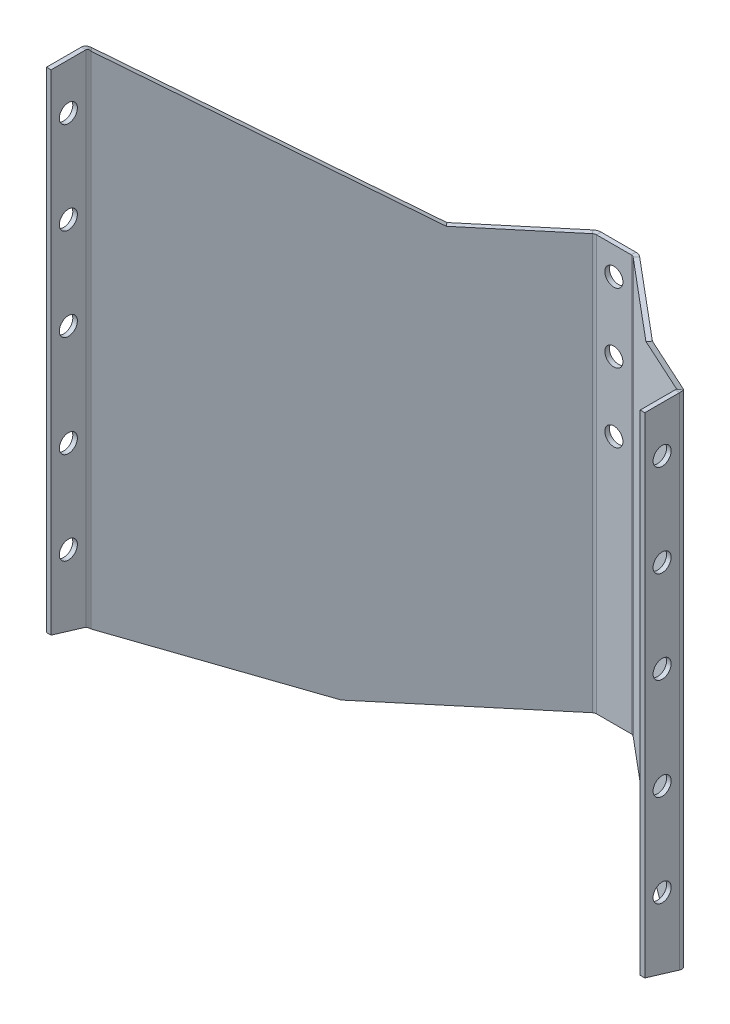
ISO-10303-21;
HEADER;
FILE_DESCRIPTION(('STEP AP214'),'2;1');
FILE_NAME('part.step','',(''),(''),'','','');
FILE_SCHEMA(('AUTOMOTIVE_DESIGN { 1 0 10303 214 1 1 1 1 }'));
ENDSEC;
DATA;
#1=APPLICATION_CONTEXT('core data for automotive mechanical design processes');
#2=APPLICATION_PROTOCOL_DEFINITION('international standard','automotive_design',2000,#1);
#3=PRODUCT_CONTEXT('',#1,'mechanical');
#4=PRODUCT('Part','Part','',(#3));
#5=PRODUCT_RELATED_PRODUCT_CATEGORY('part','',(#4));
#6=PRODUCT_DEFINITION_FORMATION('','',#4);
#7=PRODUCT_DEFINITION_CONTEXT('part definition',#1,'design');
#8=PRODUCT_DEFINITION('design','',#6,#7);
#9=PRODUCT_DEFINITION_SHAPE('','',#8);
#10=(LENGTH_UNIT() NAMED_UNIT(*) SI_UNIT(.MILLI.,.METRE.));
#11=(NAMED_UNIT(*) PLANE_ANGLE_UNIT() SI_UNIT($,.RADIAN.));
#12=(NAMED_UNIT(*) SI_UNIT($,.STERADIAN.) SOLID_ANGLE_UNIT());
#13=UNCERTAINTY_MEASURE_WITH_UNIT(LENGTH_MEASURE(1.E-05),#10,'distance_accuracy_value','');
#14=(GEOMETRIC_REPRESENTATION_CONTEXT(3) GLOBAL_UNCERTAINTY_ASSIGNED_CONTEXT((#13)) GLOBAL_UNIT_ASSIGNED_CONTEXT((#10,
#11,#12)) REPRESENTATION_CONTEXT('',''));
#15=CARTESIAN_POINT('',(0.,0.,0.));
#16=DIRECTION('',(0.,0.,1.));
#17=DIRECTION('',(1.,0.,0.));
#18=AXIS2_PLACEMENT_3D('',#15,#16,#17);
#19=CARTESIAN_POINT('',(-23.0014566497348,34.3619930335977,14.5050593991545));
#20=DIRECTION('',(-0.363652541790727,-0.880139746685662,0.305140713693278));
#21=DIRECTION('',(-0.674226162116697,0.474714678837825,0.565742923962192));
#22=AXIS2_PLACEMENT_3D('',#19,#20,#21);
#23=PLANE('',#22);
#24=DIRECTION('',(-0.642787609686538,0.,-0.766044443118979));
#25=VECTOR('',#24,1.);
#26=CARTESIAN_POINT('',(-81.5156805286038,75.5611670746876,63.6043230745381));
#27=LINE('',#26,#25);
#28=CARTESIAN_POINT('',(-80.6993402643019,75.5611670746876,64.5771995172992));
#29=VERTEX_POINT('',#28);
#30=CARTESIAN_POINT('',(-81.5156805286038,75.5611670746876,63.6043230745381));
#31=VERTEX_POINT('',#30);
#32=EDGE_CURVE('E11',#29,#31,#27,.T.);
#33=ORIENTED_EDGE('',*,*,#32,.F.);
#34=DIRECTION('',(-0.674226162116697,0.474714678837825,0.565742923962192));
#35=VECTOR('',#34,1.);
#36=CARTESIAN_POINT('',(-22.1851163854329,34.3619930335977,15.4779358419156));
#37=LINE('',#36,#35);
#38=CARTESIAN_POINT('',(-27.4941203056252,38.0999999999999,19.9327190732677));
#39=VERTEX_POINT('',#38);
#40=EDGE_CURVE('E283',#39,#29,#37,.T.);
#41=ORIENTED_EDGE('',*,*,#40,.F.);
#42=DIRECTION('',(-0.642787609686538,0.,-0.766044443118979));
#43=VECTOR('',#42,1.);
#44=CARTESIAN_POINT('',(-28.3104605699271,38.0999999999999,18.9598426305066));
#45=LINE('',#44,#43);
#46=CARTESIAN_POINT('',(-28.3104605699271,38.0999999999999,18.9598426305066));
#47=VERTEX_POINT('',#46);
#48=EDGE_CURVE('E48',#39,#47,#45,.T.);
#49=ORIENTED_EDGE('',*,*,#48,.T.);
#50=DIRECTION('',(-0.674226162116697,0.474714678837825,0.565742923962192));
#51=VECTOR('',#50,1.);
#52=CARTESIAN_POINT('',(-23.0014566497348,34.3619930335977,14.5050593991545));
#53=LINE('',#52,#51);
#54=EDGE_CURVE('E430',#47,#31,#53,.T.);
#55=ORIENTED_EDGE('',*,*,#54,.T.);
#56=EDGE_LOOP('',(#33,#41,#49,#55));
#57=FACE_BOUND('',#56,.T.);
#58=ADVANCED_FACE('F38',(#57),#23,.F.);
#59=CARTESIAN_POINT('',(-5.715,38.0999999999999,0.));
#60=DIRECTION('',(0.,-1.,0.));
#61=DIRECTION('',(-0.766044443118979,0.,0.642787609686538));
#62=AXIS2_PLACEMENT_3D('',#59,#60,#61);
#63=PLANE('',#62);
#64=ORIENTED_EDGE('',*,*,#48,.F.);
#65=DIRECTION('',(-0.766044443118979,0.,0.642787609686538));
#66=VECTOR('',#65,1.);
#67=CARTESIAN_POINT('',(-4.8986597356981,38.0999999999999,0.972876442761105));
#68=LINE('',#67,#66);
#69=CARTESIAN_POINT('',(-5.60685586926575,38.0999999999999,1.5671235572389));
#70=VERTEX_POINT('',#69);
#71=EDGE_CURVE('E289',#70,#39,#68,.T.);
#72=ORIENTED_EDGE('',*,*,#71,.F.);
#73=DIRECTION('',(-0.642787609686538,0.,-0.766044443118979));
#74=VECTOR('',#73,1.);
#75=CARTESIAN_POINT('',(-6.42319613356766,38.0999999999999,0.594247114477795));
#76=LINE('',#75,#74);
#77=CARTESIAN_POINT('',(-6.42319613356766,38.0999999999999,0.594247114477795));
#78=VERTEX_POINT('',#77);
#79=EDGE_CURVE('E413',#70,#78,#76,.T.);
#80=ORIENTED_EDGE('',*,*,#79,.T.);
#81=DIRECTION('',(-0.766044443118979,0.,0.642787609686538));
#82=VECTOR('',#81,1.);
#83=CARTESIAN_POINT('',(-5.715,38.0999999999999,0.));
#84=LINE('',#83,#82);
#85=EDGE_CURVE('E420',#78,#47,#84,.T.);
#86=ORIENTED_EDGE('',*,*,#85,.T.);
#87=EDGE_LOOP('',(#64,#72,#80,#86));
#88=FACE_BOUND('',#87,.T.);
#89=ADVANCED_FACE('F419',(#88),#63,.F.);
#90=CARTESIAN_POINT('',(-4.79051560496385,38.0999999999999,2.54));
#91=DIRECTION('',(0.,1.,0.));
#92=DIRECTION('',(0.,0.,1.));
#93=AXIS2_PLACEMENT_3D('',#90,#91,#92);
#94=PLANE('',#93);
#95=ORIENTED_EDGE('',*,*,#79,.F.);
#96=CARTESIAN_POINT('',(-4.79051560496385,38.0999999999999,2.54));
#97=DIRECTION('',(0.,-1.,0.));
#98=DIRECTION('',(0.,0.,-1.));
#99=AXIS2_PLACEMENT_3D('',#96,#97,#98);
#100=CIRCLE('',#99,1.27);
#101=CARTESIAN_POINT('',(-4.79051560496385,38.0999999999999,1.27));
#102=VERTEX_POINT('',#101);
#103=EDGE_CURVE('E293',#70,#102,#100,.T.);
#104=ORIENTED_EDGE('',*,*,#103,.T.);
#105=DIRECTION('',(0.,0.,-1.));
#106=VECTOR('',#105,1.);
#107=CARTESIAN_POINT('',(-4.79051560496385,38.0999999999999,0.));
#108=LINE('',#107,#106);
#109=CARTESIAN_POINT('',(-4.79051560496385,38.0999999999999,0.));
#110=VERTEX_POINT('',#109);
#111=EDGE_CURVE('E411',#102,#110,#108,.T.);
#112=ORIENTED_EDGE('',*,*,#111,.T.);
#113=CARTESIAN_POINT('',(-4.79051560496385,38.0999999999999,2.54));
#114=DIRECTION('',(0.,-1.,0.));
#115=DIRECTION('',(0.,0.,-1.));
#116=AXIS2_PLACEMENT_3D('',#113,#114,#115);
#117=CIRCLE('',#116,2.54);
#118=EDGE_CURVE('E239',#78,#110,#117,.T.);
#119=ORIENTED_EDGE('',*,*,#118,.F.);
#120=EDGE_LOOP('',(#95,#104,#112,#119));
#121=FACE_BOUND('',#120,.T.);
#122=ADVANCED_FACE('F434',(#121),#94,.T.);
#123=CARTESIAN_POINT('',(-82.423,38.0999999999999,0.));
#124=DIRECTION('',(0.,1.,0.));
#125=DIRECTION('',(1.,0.,0.));
#126=AXIS2_PLACEMENT_3D('',#123,#124,#125);
#127=PLANE('',#126);
#128=ORIENTED_EDGE('',*,*,#111,.F.);
#129=DIRECTION('',(-1.,0.,0.));
#130=VECTOR('',#129,1.);
#131=CARTESIAN_POINT('',(5.715,38.0999999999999,1.27));
#132=LINE('',#131,#130);
#133=CARTESIAN_POINT('',(4.79051560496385,38.0999999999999,1.27));
#134=VERTEX_POINT('',#133);
#135=EDGE_CURVE('E298',#102,#134,#132,.F.);
#136=ORIENTED_EDGE('',*,*,#135,.T.);
#137=DIRECTION('',(0.,0.,-1.));
#138=VECTOR('',#137,1.);
#139=CARTESIAN_POINT('',(4.79051560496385,38.0999999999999,0.));
#140=LINE('',#139,#138);
#141=CARTESIAN_POINT('',(4.79051560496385,38.0999999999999,0.));
#142=VERTEX_POINT('',#141);
#143=EDGE_CURVE('E409',#134,#142,#140,.T.);
#144=ORIENTED_EDGE('',*,*,#143,.T.);
#145=DIRECTION('',(1.,0.,0.));
#146=VECTOR('',#145,1.);
#147=CARTESIAN_POINT('',(-82.423,38.0999999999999,0.));
#148=LINE('',#147,#146);
#149=EDGE_CURVE('E525',#110,#142,#148,.T.);
#150=ORIENTED_EDGE('',*,*,#149,.F.);
#151=EDGE_LOOP('',(#128,#136,#144,#150));
#152=FACE_BOUND('',#151,.T.);
#153=ADVANCED_FACE('F1092',(#152),#127,.T.);
#154=CARTESIAN_POINT('',(4.79051560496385,38.0999999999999,2.54));
#155=DIRECTION('',(0.,1.,0.));
#156=DIRECTION('',(0.,0.,1.));
#157=AXIS2_PLACEMENT_3D('',#154,#155,#156);
#158=PLANE('',#157);
#159=ORIENTED_EDGE('',*,*,#143,.F.);
#160=CARTESIAN_POINT('',(4.79051560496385,38.0999999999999,2.54));
#161=DIRECTION('',(0.,-1.,0.));
#162=DIRECTION('',(0.,0.,-1.));
#163=AXIS2_PLACEMENT_3D('',#160,#161,#162);
#164=CIRCLE('',#163,1.27);
#165=CARTESIAN_POINT('',(5.60685586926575,38.0999999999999,1.5671235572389));
#166=VERTEX_POINT('',#165);
#167=EDGE_CURVE('E302',#134,#166,#164,.T.);
#168=ORIENTED_EDGE('',*,*,#167,.T.);
#169=DIRECTION('',(0.642787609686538,0.,-0.766044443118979));
#170=VECTOR('',#169,1.);
#171=CARTESIAN_POINT('',(6.42319613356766,38.0999999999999,0.594247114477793));
#172=LINE('',#171,#170);
#173=CARTESIAN_POINT('',(6.42319613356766,38.0999999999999,0.594247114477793));
#174=VERTEX_POINT('',#173);
#175=EDGE_CURVE('E407',#166,#174,#172,.T.);
#176=ORIENTED_EDGE('',*,*,#175,.T.);
#177=CARTESIAN_POINT('',(4.79051560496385,38.0999999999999,2.54));
#178=DIRECTION('',(0.,-1.,0.));
#179=DIRECTION('',(0.,0.,-1.));
#180=AXIS2_PLACEMENT_3D('',#177,#178,#179);
#181=CIRCLE('',#180,2.54);
#182=EDGE_CURVE('E449',#142,#174,#181,.T.);
#183=ORIENTED_EDGE('',*,*,#182,.F.);
#184=EDGE_LOOP('',(#159,#168,#176,#183));
#185=FACE_BOUND('',#184,.T.);
#186=ADVANCED_FACE('F1081',(#185),#158,.T.);
#187=CARTESIAN_POINT('',(5.715,38.0999999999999,0.));
#188=DIRECTION('',(0.,-1.,0.));
#189=DIRECTION('',(-0.766044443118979,0.,-0.642787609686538));
#190=AXIS2_PLACEMENT_3D('',#187,#188,#189);
#191=PLANE('',#190);
#192=ORIENTED_EDGE('',*,*,#175,.F.);
#193=DIRECTION('',(-0.766044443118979,0.,-0.642787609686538));
#194=VECTOR('',#193,1.);
#195=CARTESIAN_POINT('',(4.8986597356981,38.0999999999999,0.972876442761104));
#196=LINE('',#195,#194);
#197=CARTESIAN_POINT('',(27.4941203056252,38.0999999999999,19.9327190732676));
#198=VERTEX_POINT('',#197);
#199=EDGE_CURVE('E306',#198,#166,#196,.T.);
#200=ORIENTED_EDGE('',*,*,#199,.F.);
#201=DIRECTION('',(0.642787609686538,0.,-0.766044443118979));
#202=VECTOR('',#201,1.);
#203=CARTESIAN_POINT('',(28.3104605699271,38.0999999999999,18.9598426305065));
#204=LINE('',#203,#202);
#205=CARTESIAN_POINT('',(28.3104605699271,38.0999999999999,18.9598426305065));
#206=VERTEX_POINT('',#205);
#207=EDGE_CURVE('E405',#198,#206,#204,.T.);
#208=ORIENTED_EDGE('',*,*,#207,.T.);
#209=DIRECTION('',(-0.766044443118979,0.,-0.642787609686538));
#210=VECTOR('',#209,1.);
#211=CARTESIAN_POINT('',(5.715,38.0999999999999,0.));
#212=LINE('',#211,#210);
#213=EDGE_CURVE('E513',#206,#174,#212,.T.);
#214=ORIENTED_EDGE('',*,*,#213,.T.);
#215=EDGE_LOOP('',(#192,#200,#208,#214));
#216=FACE_BOUND('',#215,.T.);
#217=ADVANCED_FACE('F1070',(#216),#191,.F.);
#218=CARTESIAN_POINT('',(23.0014566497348,34.3619930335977,14.5050593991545));
#219=DIRECTION('',(0.363652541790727,-0.880139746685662,0.305140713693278));
#220=DIRECTION('',(-0.674226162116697,-0.474714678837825,-0.565742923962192));
#221=AXIS2_PLACEMENT_3D('',#218,#219,#220);
#222=PLANE('',#221);
#223=ORIENTED_EDGE('',*,*,#207,.F.);
#224=DIRECTION('',(-0.674226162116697,-0.474714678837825,-0.565742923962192));
#225=VECTOR('',#224,1.);
#226=CARTESIAN_POINT('',(22.1851163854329,34.3619930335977,15.4779358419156));
#227=LINE('',#226,#225);
#228=CARTESIAN_POINT('',(80.699340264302,75.5611670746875,64.5771995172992));
#229=VERTEX_POINT('',#228);
#230=EDGE_CURVE('E316',#229,#198,#227,.T.);
#231=ORIENTED_EDGE('',*,*,#230,.F.);
#232=DIRECTION('',(0.642787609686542,0.,-0.766044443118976));
#233=VECTOR('',#232,1.);
#234=CARTESIAN_POINT('',(81.5156805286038,75.5611670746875,63.604323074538));
#235=LINE('',#234,#233);
#236=CARTESIAN_POINT('',(81.5156805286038,75.5611670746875,63.604323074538));
#237=VERTEX_POINT('',#236);
#238=EDGE_CURVE('E403',#229,#237,#235,.T.);
#239=ORIENTED_EDGE('',*,*,#238,.T.);
#240=DIRECTION('',(-0.674226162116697,-0.474714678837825,-0.565742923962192));
#241=VECTOR('',#240,1.);
#242=CARTESIAN_POINT('',(23.0014566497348,34.3619930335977,14.5050593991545));
#243=LINE('',#242,#241);
#244=EDGE_CURVE('E510',#237,#206,#243,.T.);
#245=ORIENTED_EDGE('',*,*,#244,.T.);
#246=EDGE_LOOP('',(#223,#231,#239,#245));
#247=FACE_BOUND('',#246,.T.);
#248=ADVANCED_FACE('F1059',(#247),#222,.F.);
#249=CARTESIAN_POINT('',(78.613,72.6232319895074,65.5500759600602));
#250=CARTESIAN_POINT('',(78.1896666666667,72.6232319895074,65.5500759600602));
#251=CARTESIAN_POINT('',(77.7663333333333,72.6232319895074,65.5500759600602));
#252=CARTESIAN_POINT('',(77.343,72.6232319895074,65.5500759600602));
#253=CARTESIAN_POINT('',(78.613,72.6232319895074,63.0100759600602));
#254=CARTESIAN_POINT('',(78.1896666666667,72.6232319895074,62.1634092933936));
#255=CARTESIAN_POINT('',(77.7663333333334,72.6232319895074,61.3167426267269));
#256=CARTESIAN_POINT('',(77.343,72.6232319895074,60.4700759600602));
#257=CARTESIAN_POINT('',(81.153,76.1999999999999,63.0100759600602));
#258=CARTESIAN_POINT('',(81.5763333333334,76.2,62.1634092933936));
#259=CARTESIAN_POINT('',(81.9996666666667,76.2,61.3167426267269));
#260=CARTESIAN_POINT('',(82.423,76.1999999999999,60.4700759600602));
#261=CARTESIAN_POINT('',(81.153,76.1999999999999,65.5500759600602));
#262=CARTESIAN_POINT('',(81.5763333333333,76.1999999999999,65.5500759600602));
#263=CARTESIAN_POINT('',(81.9996666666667,76.1999999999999,65.5500759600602));
#264=CARTESIAN_POINT('',(82.423,76.1999999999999,65.5500759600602));
#265=CARTESIAN_POINT('',(81.153,76.1999999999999,68.0900759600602));
#266=CARTESIAN_POINT('',(81.5763333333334,76.2,68.9367426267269));
#267=CARTESIAN_POINT('',(81.9996666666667,76.2,69.7834092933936));
#268=CARTESIAN_POINT('',(82.423,76.1999999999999,70.6300759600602));
#269=CARTESIAN_POINT('',(78.613,72.6232319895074,68.0900759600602));
#270=CARTESIAN_POINT('',(78.1896666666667,72.6232319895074,68.9367426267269));
#271=CARTESIAN_POINT('',(77.7663333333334,72.6232319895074,69.7834092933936));
#272=CARTESIAN_POINT('',(77.343,72.6232319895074,70.6300759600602));
#273=CARTESIAN_POINT('',(78.613,72.6232319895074,65.5500759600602));
#274=CARTESIAN_POINT('',(78.1896666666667,72.6232319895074,65.5500759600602));
#275=CARTESIAN_POINT('',(77.7663333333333,72.6232319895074,65.5500759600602));
#276=CARTESIAN_POINT('',(77.343,72.6232319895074,65.5500759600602));
#277=(BOUNDED_SURFACE() B_SPLINE_SURFACE(3,3,((#249,#250,#251,#252),(#253,#254,#255,#256),(#257,
#258,#259,#260),(#261,#262,#263,#264),(#265,#266,#267,#268),(#269,#270,#271,#272),(#273,#274,
#275,#276)),.UNSPECIFIED.,.T.,.F.,.F.) B_SPLINE_SURFACE_WITH_KNOTS((4,3,4),(4,4),(0.,0.5,1.),
(0.,1.),.UNSPECIFIED.) GEOMETRIC_REPRESENTATION_ITEM() RATIONAL_B_SPLINE_SURFACE(((1.,1.,1.,1.),
(0.333333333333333,0.333333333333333,0.333333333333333,0.333333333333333),(0.333333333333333,
0.333333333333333,0.333333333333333,0.333333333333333),(1.,1.,1.,1.),(0.333333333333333,
0.333333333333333,0.333333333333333,0.333333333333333),(0.333333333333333,0.333333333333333,
0.333333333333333,0.333333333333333),(1.,1.,1.,1.))) REPRESENTATION_ITEM('') SURFACE());
#278=CARTESIAN_POINT('',(79.883,74.4116159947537,65.5500759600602));
#279=DIRECTION('',(0.815329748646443,-0.578996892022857,0.));
#280=DIRECTION('',(-0.578996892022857,-0.815329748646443,0.));
#281=AXIS2_PLACEMENT_3D('',#278,#279,#280);
#282=ELLIPSE('',#281,2.19344873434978,1.27);
#283=CARTESIAN_POINT('',(81.153,76.1999999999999,65.5500759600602));
#284=VERTEX_POINT('',#283);
#285=EDGE_CURVE('E284',#229,#284,#282,.T.);
#286=DIRECTION('',(1.,0.,0.));
#287=VECTOR('',#286,1.);
#288=CARTESIAN_POINT('',(82.423,76.1999999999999,65.5500759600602));
#289=LINE('',#288,#287);
#290=CARTESIAN_POINT('',(82.423,76.1999999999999,65.5500759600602));
#291=VERTEX_POINT('',#290);
#292=EDGE_CURVE('E401',#284,#291,#289,.T.);
#293=CARTESIAN_POINT('',(79.883,74.4116159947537,65.5500759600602));
#294=DIRECTION('',(0.575703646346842,-0.817658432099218,0.));
#295=DIRECTION('',(-0.817658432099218,-0.575703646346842,0.));
#296=AXIS2_PLACEMENT_3D('',#293,#294,#295);
#297=ELLIPSE('',#296,3.10643161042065,2.54);
#298=EDGE_CURVE('E458',#237,#291,#297,.T.);
#299=ORIENTED_EDGE('',*,*,#238,.F.);
#300=ORIENTED_EDGE('',*,*,#285,.T.);
#301=ORIENTED_EDGE('',*,*,#292,.T.);
#302=ORIENTED_EDGE('',*,*,#298,.F.);
#303=EDGE_LOOP('',(#299,#300,#301,#302));
#304=FACE_BOUND('',#303,.T.);
#305=ADVANCED_FACE('F1048',(#304),#277,.T.);
#306=CARTESIAN_POINT('',(82.423,76.1999999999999,64.3656545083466));
#307=DIRECTION('',(0.,1.,0.));
#308=DIRECTION('',(0.,0.,1.));
#309=AXIS2_PLACEMENT_3D('',#306,#307,#308);
#310=PLANE('',#309);
#311=ORIENTED_EDGE('',*,*,#292,.F.);
#312=DIRECTION('',(0.,0.,-1.));
#313=VECTOR('',#312,1.);
#314=CARTESIAN_POINT('',(81.153,76.1999999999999,64.3656545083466));
#315=LINE('',#314,#313);
#316=CARTESIAN_POINT('',(81.153,76.1999999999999,75.1606545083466));
#317=VERTEX_POINT('',#316);
#318=EDGE_CURVE('E315',#284,#317,#315,.F.);
#319=ORIENTED_EDGE('',*,*,#318,.T.);
#320=DIRECTION('',(1.,0.,0.));
#321=VECTOR('',#320,1.);
#322=CARTESIAN_POINT('',(82.423,76.1999999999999,75.1606545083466));
#323=LINE('',#322,#321);
#324=CARTESIAN_POINT('',(82.423,76.1999999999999,75.1606545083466));
#325=VERTEX_POINT('',#324);
#326=EDGE_CURVE('E399',#317,#325,#323,.T.);
#327=ORIENTED_EDGE('',*,*,#326,.T.);
#328=DIRECTION('',(0.,0.,1.));
#329=VECTOR('',#328,1.);
#330=CARTESIAN_POINT('',(82.423,76.1999999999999,64.3656545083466));
#331=LINE('',#330,#329);
#332=EDGE_CURVE('E504',#291,#325,#331,.T.);
#333=ORIENTED_EDGE('',*,*,#332,.F.);
#334=EDGE_LOOP('',(#311,#319,#327,#333));
#335=FACE_BOUND('',#334,.T.);
#336=ADVANCED_FACE('F1037',(#335),#310,.T.);
#337=CARTESIAN_POINT('',(82.423,76.1999999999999,75.1606545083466));
#338=DIRECTION('',(0.,0.,1.));
#339=DIRECTION('',(0.,-1.,0.));
#340=AXIS2_PLACEMENT_3D('',#337,#338,#339);
#341=PLANE('',#340);
#342=ORIENTED_EDGE('',*,*,#326,.F.);
#343=DIRECTION('',(0.,1.,0.));
#344=VECTOR('',#343,1.);
#345=CARTESIAN_POINT('',(81.153,76.1999999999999,75.1606545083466));
#346=LINE('',#345,#344);
#347=CARTESIAN_POINT('',(81.153,-58.6739999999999,75.1606545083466));
#348=VERTEX_POINT('',#347);
#349=EDGE_CURVE('E317',#317,#348,#346,.F.);
#350=ORIENTED_EDGE('',*,*,#349,.T.);
#351=DIRECTION('',(1.,0.,0.));
#352=VECTOR('',#351,1.);
#353=CARTESIAN_POINT('',(82.423,-58.6739999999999,75.1606545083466));
#354=LINE('',#353,#352);
#355=CARTESIAN_POINT('',(82.423,-58.6739999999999,75.1606545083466));
#356=VERTEX_POINT('',#355);
#357=EDGE_CURVE('E397',#348,#356,#354,.T.);
#358=ORIENTED_EDGE('',*,*,#357,.T.);
#359=DIRECTION('',(0.,-1.,0.));
#360=VECTOR('',#359,1.);
#361=CARTESIAN_POINT('',(82.423,76.1999999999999,75.1606545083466));
#362=LINE('',#361,#360);
#363=EDGE_CURVE('E501',#325,#356,#362,.T.);
#364=ORIENTED_EDGE('',*,*,#363,.F.);
#365=EDGE_LOOP('',(#342,#350,#358,#364));
#366=FACE_BOUND('',#365,.T.);
#367=ADVANCED_FACE('F1026',(#366),#341,.T.);
#368=CARTESIAN_POINT('',(82.423,-61.934903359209,64.3656545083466));
#369=DIRECTION('',(0.,0.957277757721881,-0.289170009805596));
#370=DIRECTION('',(0.,0.289170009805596,0.957277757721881));
#371=AXIS2_PLACEMENT_3D('',#368,#369,#370);
#372=PLANE('',#371);
#373=ORIENTED_EDGE('',*,*,#357,.F.);
#374=DIRECTION('',(0.,0.289170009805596,0.957277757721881));
#375=VECTOR('',#374,1.);
#376=CARTESIAN_POINT('',(81.153,-61.934903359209,64.3656545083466));
#377=LINE('',#376,#375);
#378=CARTESIAN_POINT('',(81.153,-61.5771188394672,65.5500759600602));
#379=VERTEX_POINT('',#378);
#380=EDGE_CURVE('E312',#379,#348,#377,.T.);
#381=ORIENTED_EDGE('',*,*,#380,.F.);
#382=DIRECTION('',(1.,0.,0.));
#383=VECTOR('',#382,1.);
#384=CARTESIAN_POINT('',(82.423,-61.5771188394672,65.5500759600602));
#385=LINE('',#384,#383);
#386=CARTESIAN_POINT('',(82.423,-61.5771188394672,65.5500759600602));
#387=VERTEX_POINT('',#386);
#388=EDGE_CURVE('E395',#379,#387,#385,.T.);
#389=ORIENTED_EDGE('',*,*,#388,.T.);
#390=DIRECTION('',(0.,0.289170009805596,0.957277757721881));
#391=VECTOR('',#390,1.);
#392=CARTESIAN_POINT('',(82.423,-61.934903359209,64.3656545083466));
#393=LINE('',#392,#391);
#394=EDGE_CURVE('E507',#387,#356,#393,.T.);
#395=ORIENTED_EDGE('',*,*,#394,.T.);
#396=EDGE_LOOP('',(#373,#381,#389,#395));
#397=FACE_BOUND('',#396,.T.);
#398=ADVANCED_FACE('F1015',(#397),#372,.F.);
#399=CARTESIAN_POINT('',(78.9556762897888,-62.7021708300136,63.18540457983));
#400=CARTESIAN_POINT('',(79.1102302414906,-62.7021708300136,63.579516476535));
#401=CARTESIAN_POINT('',(79.2647841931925,-62.7021708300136,63.9736283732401));
#402=CARTESIAN_POINT('',(79.4193381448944,-62.7021708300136,64.3677402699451));
#403=CARTESIAN_POINT('',(74.2263335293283,-62.7021708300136,65.0400520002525));
#404=CARTESIAN_POINT('',(75.1691112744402,-62.7021708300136,65.1250559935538));
#405=CARTESIAN_POINT('',(76.1118890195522,-62.7021708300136,65.2100599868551));
#406=CARTESIAN_POINT('',(77.0546667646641,-62.7021708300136,65.2950639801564));
#407=CARTESIAN_POINT('',(76.0809809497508,-61.0538493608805,69.769394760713));
#408=CARTESIAN_POINT('',(76.714650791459,-61.0538493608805,69.0661749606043));
#409=CARTESIAN_POINT('',(77.3483206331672,-61.0538493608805,68.3629551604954));
#410=CARTESIAN_POINT('',(77.9819904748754,-61.0538493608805,67.6597353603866));
#411=CARTESIAN_POINT('',(80.8103237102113,-61.0538493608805,67.9147473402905));
#412=CARTESIAN_POINT('',(80.6557697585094,-61.0538493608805,67.5206354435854));
#413=CARTESIAN_POINT('',(80.5012158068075,-61.0538493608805,67.1265235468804));
#414=CARTESIAN_POINT('',(80.3466618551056,-61.0538493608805,66.7324116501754));
#415=CARTESIAN_POINT('',(85.5396664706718,-61.0538493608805,66.060099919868));
#416=CARTESIAN_POINT('',(84.5968887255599,-61.0538493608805,65.9750959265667));
#417=CARTESIAN_POINT('',(83.6541109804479,-61.0538493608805,65.8900919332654));
#418=CARTESIAN_POINT('',(82.7113332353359,-61.0538493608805,65.8050879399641));
#419=CARTESIAN_POINT('',(83.6850190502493,-62.7021708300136,61.3307571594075));
#420=CARTESIAN_POINT('',(83.0513492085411,-62.7021708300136,62.0339769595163));
#421=CARTESIAN_POINT('',(82.4176793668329,-62.7021708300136,62.7371967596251));
#422=CARTESIAN_POINT('',(81.7840095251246,-62.7021708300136,63.4404165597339));
#423=CARTESIAN_POINT('',(78.9556762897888,-62.7021708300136,63.18540457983));
#424=CARTESIAN_POINT('',(79.1102302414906,-62.7021708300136,63.579516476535));
#425=CARTESIAN_POINT('',(79.2647841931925,-62.7021708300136,63.9736283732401));
#426=CARTESIAN_POINT('',(79.4193381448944,-62.7021708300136,64.3677402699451));
#427=(BOUNDED_SURFACE() B_SPLINE_SURFACE(3,3,((#399,#400,#401,#402),(#403,#404,#405,#406),(#407,
#408,#409,#410),(#411,#412,#413,#414),(#415,#416,#417,#418),(#419,#420,#421,#422),(#423,#424,
#425,#426)),.UNSPECIFIED.,.T.,.F.,.F.) B_SPLINE_SURFACE_WITH_KNOTS((4,3,4),(4,4),(0.,0.5,1.),
(0.,1.),.UNSPECIFIED.) GEOMETRIC_REPRESENTATION_ITEM() RATIONAL_B_SPLINE_SURFACE(((1.,1.,1.,1.),
(0.333333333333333,0.333333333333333,0.333333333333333,0.333333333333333),(0.333333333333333,
0.333333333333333,0.333333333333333,0.333333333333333),(1.,1.,1.,1.),(0.333333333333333,
0.333333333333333,0.333333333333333,0.333333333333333),(0.333333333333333,0.333333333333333,
0.333333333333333,0.333333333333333),(1.,1.,1.,1.))) REPRESENTATION_ITEM('') SURFACE());
#428=CARTESIAN_POINT('',(79.883,-61.8780100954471,65.5500759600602));
#429=DIRECTION('',(0.198741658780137,-0.838847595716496,0.506790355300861));
#430=DIRECTION('',(-0.306253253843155,-0.544366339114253,-0.780944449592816));
#431=AXIS2_PLACEMENT_3D('',#428,#429,#430);
#432=ELLIPSE('',#431,1.51398180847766,1.27);
#433=CARTESIAN_POINT('',(80.6993402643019,-62.2723649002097,64.5771995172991));
#434=VERTEX_POINT('',#433);
#435=EDGE_CURVE('E309',#379,#434,#432,.F.);
#436=DIRECTION('',(0.642787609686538,0.,-0.766044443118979));
#437=VECTOR('',#436,1.);
#438=CARTESIAN_POINT('',(81.5156805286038,-62.2723649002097,63.604323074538));
#439=LINE('',#438,#437);
#440=CARTESIAN_POINT('',(81.5156805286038,-62.2723649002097,63.604323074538));
#441=VERTEX_POINT('',#440);
#442=EDGE_CURVE('E393',#434,#441,#439,.T.);
#443=CARTESIAN_POINT('',(79.883,-61.8780100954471,65.5500759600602));
#444=DIRECTION('',(0.112678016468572,-0.951181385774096,0.28732844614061));
#445=DIRECTION('',(-0.347264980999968,-0.308632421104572,-0.885524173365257));
#446=AXIS2_PLACEMENT_3D('',#443,#444,#445);
#447=ELLIPSE('',#446,2.6703634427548,2.54);
#448=EDGE_CURVE('E452',#387,#441,#447,.F.);
#449=ORIENTED_EDGE('',*,*,#388,.F.);
#450=ORIENTED_EDGE('',*,*,#435,.T.);
#451=ORIENTED_EDGE('',*,*,#442,.T.);
#452=ORIENTED_EDGE('',*,*,#448,.F.);
#453=EDGE_LOOP('',(#449,#450,#451,#452));
#454=FACE_BOUND('',#453,.T.);
#455=ADVANCED_FACE('F1004',(#454),#427,.F.);
#456=CARTESIAN_POINT('',(39.3599292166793,-77.9514561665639,28.2314476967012));
#457=DIRECTION('',(-0.20990533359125,0.961726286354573,-0.176131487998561));
#458=DIRECTION('',(0.736725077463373,0.27401195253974,0.618185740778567));
#459=AXIS2_PLACEMENT_3D('',#456,#457,#458);
#460=PLANE('',#459);
#461=ORIENTED_EDGE('',*,*,#442,.F.);
#462=DIRECTION('',(0.736725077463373,0.27401195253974,0.618185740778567));
#463=VECTOR('',#462,1.);
#464=CARTESIAN_POINT('',(38.5435889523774,-77.9514561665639,29.2043241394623));
#465=LINE('',#464,#463);
#466=CARTESIAN_POINT('',(43.2526597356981,-76.1999999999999,33.1557036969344));
#467=VERTEX_POINT('',#466);
#468=EDGE_CURVE('E297',#467,#434,#465,.T.);
#469=ORIENTED_EDGE('',*,*,#468,.F.);
#470=DIRECTION('',(0.642787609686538,0.,-0.766044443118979));
#471=VECTOR('',#470,1.);
#472=CARTESIAN_POINT('',(44.069,-76.1999999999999,32.1828272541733));
#473=LINE('',#472,#471);
#474=CARTESIAN_POINT('',(44.069,-76.1999999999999,32.1828272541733));
#475=VERTEX_POINT('',#474);
#476=EDGE_CURVE('E391',#467,#475,#473,.T.);
#477=ORIENTED_EDGE('',*,*,#476,.T.);
#478=DIRECTION('',(0.736725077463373,0.27401195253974,0.618185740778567));
#479=VECTOR('',#478,1.);
#480=CARTESIAN_POINT('',(39.3599292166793,-77.9514561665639,28.2314476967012));
#481=LINE('',#480,#479);
#482=EDGE_CURVE('E519',#475,#441,#481,.T.);
#483=ORIENTED_EDGE('',*,*,#482,.T.);
#484=EDGE_LOOP('',(#461,#469,#477,#483));
#485=FACE_BOUND('',#484,.T.);
#486=ADVANCED_FACE('F993',(#485),#460,.F.);
#487=CARTESIAN_POINT('',(5.715,-76.1999999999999,0.));
#488=DIRECTION('',(0.,1.,0.));
#489=DIRECTION('',(0.766044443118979,0.,0.642787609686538));
#490=AXIS2_PLACEMENT_3D('',#487,#488,#489);
#491=PLANE('',#490);
#492=ORIENTED_EDGE('',*,*,#476,.F.);
#493=DIRECTION('',(-0.766044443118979,0.,-0.642787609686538));
#494=VECTOR('',#493,1.);
#495=CARTESIAN_POINT('',(4.8986597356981,-76.1999999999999,0.972876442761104));
#496=LINE('',#495,#494);
#497=CARTESIAN_POINT('',(5.60685586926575,-76.1999999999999,1.5671235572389));
#498=VERTEX_POINT('',#497);
#499=EDGE_CURVE('E303',#498,#467,#496,.F.);
#500=ORIENTED_EDGE('',*,*,#499,.F.);
#501=DIRECTION('',(0.642787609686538,0.,-0.766044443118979));
#502=VECTOR('',#501,1.);
#503=CARTESIAN_POINT('',(6.42319613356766,-76.1999999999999,0.594247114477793));
#504=LINE('',#503,#502);
#505=CARTESIAN_POINT('',(6.42319613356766,-76.1999999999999,0.594247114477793));
#506=VERTEX_POINT('',#505);
#507=EDGE_CURVE('E389',#498,#506,#504,.T.);
#508=ORIENTED_EDGE('',*,*,#507,.T.);
#509=DIRECTION('',(0.766044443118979,0.,0.642787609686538));
#510=VECTOR('',#509,1.);
#511=CARTESIAN_POINT('',(5.715,-76.1999999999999,0.));
#512=LINE('',#511,#510);
#513=EDGE_CURVE('E516',#506,#475,#512,.T.);
#514=ORIENTED_EDGE('',*,*,#513,.T.);
#515=EDGE_LOOP('',(#492,#500,#508,#514));
#516=FACE_BOUND('',#515,.T.);
#517=ADVANCED_FACE('F982',(#516),#491,.F.);
#518=CARTESIAN_POINT('',(4.79051560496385,-76.1999999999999,2.54));
#519=DIRECTION('',(0.,1.,0.));
#520=DIRECTION('',(0.,0.,1.));
#521=AXIS2_PLACEMENT_3D('',#518,#519,#520);
#522=PLANE('',#521);
#523=ORIENTED_EDGE('',*,*,#507,.F.);
#524=CARTESIAN_POINT('',(4.79051560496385,-76.1999999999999,2.54));
#525=DIRECTION('',(0.,-1.,0.));
#526=DIRECTION('',(0.,0.,-1.));
#527=AXIS2_PLACEMENT_3D('',#524,#525,#526);
#528=CIRCLE('',#527,1.27);
#529=CARTESIAN_POINT('',(4.79051560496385,-76.1999999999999,1.27));
#530=VERTEX_POINT('',#529);
#531=EDGE_CURVE('E299',#498,#530,#528,.F.);
#532=ORIENTED_EDGE('',*,*,#531,.T.);
#533=DIRECTION('',(0.,0.,-1.));
#534=VECTOR('',#533,1.);
#535=CARTESIAN_POINT('',(4.79051560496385,-76.1999999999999,0.));
#536=LINE('',#535,#534);
#537=CARTESIAN_POINT('',(4.79051560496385,-76.1999999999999,0.));
#538=VERTEX_POINT('',#537);
#539=EDGE_CURVE('E387',#530,#538,#536,.T.);
#540=ORIENTED_EDGE('',*,*,#539,.T.);
#541=CARTESIAN_POINT('',(4.79051560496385,-76.1999999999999,2.54));
#542=DIRECTION('',(0.,-1.,0.));
#543=DIRECTION('',(0.,0.,-1.));
#544=AXIS2_PLACEMENT_3D('',#541,#542,#543);
#545=CIRCLE('',#544,2.54);
#546=EDGE_CURVE('E438',#506,#538,#545,.F.);
#547=ORIENTED_EDGE('',*,*,#546,.F.);
#548=EDGE_LOOP('',(#523,#532,#540,#547));
#549=FACE_BOUND('',#548,.T.);
#550=ADVANCED_FACE('F971',(#549),#522,.F.);
#551=CARTESIAN_POINT('',(5.715,-76.1999999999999,0.));
#552=DIRECTION('',(0.,1.,0.));
#553=DIRECTION('',(1.,0.,0.));
#554=AXIS2_PLACEMENT_3D('',#551,#552,#553);
#555=PLANE('',#554);
#556=ORIENTED_EDGE('',*,*,#539,.F.);
#557=DIRECTION('',(-1.,0.,0.));
#558=VECTOR('',#557,1.);
#559=CARTESIAN_POINT('',(5.715,-76.1999999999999,1.27));
#560=LINE('',#559,#558);
#561=CARTESIAN_POINT('',(-4.79051560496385,-76.1999999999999,1.27));
#562=VERTEX_POINT('',#561);
#563=EDGE_CURVE('E294',#562,#530,#560,.F.);
#564=ORIENTED_EDGE('',*,*,#563,.F.);
#565=DIRECTION('',(0.,0.,-1.));
#566=VECTOR('',#565,1.);
#567=CARTESIAN_POINT('',(-4.79051560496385,-76.1999999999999,0.));
#568=LINE('',#567,#566);
#569=CARTESIAN_POINT('',(-4.79051560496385,-76.1999999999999,0.));
#570=VERTEX_POINT('',#569);
#571=EDGE_CURVE('E385',#562,#570,#568,.T.);
#572=ORIENTED_EDGE('',*,*,#571,.T.);
#573=DIRECTION('',(1.,0.,0.));
#574=VECTOR('',#573,1.);
#575=CARTESIAN_POINT('',(5.715,-76.1999999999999,0.));
#576=LINE('',#575,#574);
#577=EDGE_CURVE('E522',#570,#538,#576,.T.);
#578=ORIENTED_EDGE('',*,*,#577,.T.);
#579=EDGE_LOOP('',(#556,#564,#572,#578));
#580=FACE_BOUND('',#579,.T.);
#581=ADVANCED_FACE('F960',(#580),#555,.F.);
#582=CARTESIAN_POINT('',(-4.79051560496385,-76.1999999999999,2.54));
#583=DIRECTION('',(0.,1.,0.));
#584=DIRECTION('',(0.,0.,1.));
#585=AXIS2_PLACEMENT_3D('',#582,#583,#584);
#586=PLANE('',#585);
#587=ORIENTED_EDGE('',*,*,#571,.F.);
#588=CARTESIAN_POINT('',(-4.79051560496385,-76.1999999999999,2.54));
#589=DIRECTION('',(0.,-1.,0.));
#590=DIRECTION('',(0.,0.,-1.));
#591=AXIS2_PLACEMENT_3D('',#588,#589,#590);
#592=CIRCLE('',#591,1.27);
#593=CARTESIAN_POINT('',(-5.60685586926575,-76.1999999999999,1.5671235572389));
#594=VERTEX_POINT('',#593);
#595=EDGE_CURVE('E290',#562,#594,#592,.F.);
#596=ORIENTED_EDGE('',*,*,#595,.T.);
#597=DIRECTION('',(-0.642787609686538,0.,-0.766044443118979));
#598=VECTOR('',#597,1.);
#599=CARTESIAN_POINT('',(-6.42319613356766,-76.1999999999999,0.594247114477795));
#600=LINE('',#599,#598);
#601=CARTESIAN_POINT('',(-6.42319613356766,-76.1999999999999,0.594247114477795));
#602=VERTEX_POINT('',#601);
#603=EDGE_CURVE('E383',#594,#602,#600,.T.);
#604=ORIENTED_EDGE('',*,*,#603,.T.);
#605=CARTESIAN_POINT('',(-4.79051560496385,-76.1999999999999,2.54));
#606=DIRECTION('',(0.,-1.,0.));
#607=DIRECTION('',(0.,0.,-1.));
#608=AXIS2_PLACEMENT_3D('',#605,#606,#607);
#609=CIRCLE('',#608,2.54);
#610=EDGE_CURVE('E213',#570,#602,#609,.F.);
#611=ORIENTED_EDGE('',*,*,#610,.F.);
#612=EDGE_LOOP('',(#587,#596,#604,#611));
#613=FACE_BOUND('',#612,.T.);
#614=ADVANCED_FACE('F949',(#613),#586,.F.);
#615=CARTESIAN_POINT('',(-5.715,-76.1999999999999,0.));
#616=DIRECTION('',(0.,1.,0.));
#617=DIRECTION('',(0.766044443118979,0.,-0.642787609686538));
#618=AXIS2_PLACEMENT_3D('',#615,#616,#617);
#619=PLANE('',#618);
#620=ORIENTED_EDGE('',*,*,#603,.F.);
#621=DIRECTION('',(-0.766044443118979,0.,0.642787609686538));
#622=VECTOR('',#621,1.);
#623=CARTESIAN_POINT('',(-4.8986597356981,-76.1999999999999,0.972876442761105));
#624=LINE('',#623,#622);
#625=CARTESIAN_POINT('',(-43.2526597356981,-76.1999999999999,33.1557036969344));
#626=VERTEX_POINT('',#625);
#627=EDGE_CURVE('E285',#626,#594,#624,.F.);
#628=ORIENTED_EDGE('',*,*,#627,.F.);
#629=DIRECTION('',(-0.642787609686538,0.,-0.766044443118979));
#630=VECTOR('',#629,1.);
#631=CARTESIAN_POINT('',(-44.069,-76.1999999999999,32.1828272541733));
#632=LINE('',#631,#630);
#633=CARTESIAN_POINT('',(-44.069,-76.1999999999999,32.1828272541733));
#634=VERTEX_POINT('',#633);
#635=EDGE_CURVE('E381',#626,#634,#632,.T.);
#636=ORIENTED_EDGE('',*,*,#635,.T.);
#637=DIRECTION('',(0.766044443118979,0.,-0.642787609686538));
#638=VECTOR('',#637,1.);
#639=CARTESIAN_POINT('',(-5.715,-76.1999999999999,0.));
#640=LINE('',#639,#638);
#641=EDGE_CURVE('E431',#634,#602,#640,.T.);
#642=ORIENTED_EDGE('',*,*,#641,.T.);
#643=EDGE_LOOP('',(#620,#628,#636,#642));
#644=FACE_BOUND('',#643,.T.);
#645=ADVANCED_FACE('F939',(#644),#619,.F.);
#646=CARTESIAN_POINT('',(-39.3599292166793,-77.9514561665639,28.2314476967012));
#647=DIRECTION('',(0.20990533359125,0.961726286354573,-0.176131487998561));
#648=DIRECTION('',(0.736725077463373,-0.27401195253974,-0.618185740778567));
#649=AXIS2_PLACEMENT_3D('',#646,#647,#648);
#650=PLANE('',#649);
#651=ORIENTED_EDGE('',*,*,#635,.F.);
#652=DIRECTION('',(0.736725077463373,-0.27401195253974,-0.618185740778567));
#653=VECTOR('',#652,1.);
#654=CARTESIAN_POINT('',(-38.5435889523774,-77.9514561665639,29.2043241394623));
#655=LINE('',#654,#653);
#656=CARTESIAN_POINT('',(-80.6993402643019,-62.2723649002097,64.5771995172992));
#657=VERTEX_POINT('',#656);
#658=EDGE_CURVE('E280',#657,#626,#655,.T.);
#659=ORIENTED_EDGE('',*,*,#658,.F.);
#660=DIRECTION('',(-0.642787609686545,0.,-0.766044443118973));
#661=VECTOR('',#660,1.);
#662=CARTESIAN_POINT('',(-81.5156805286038,-62.2723649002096,63.6043230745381));
#663=LINE('',#662,#661);
#664=CARTESIAN_POINT('',(-81.5156805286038,-62.2723649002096,63.6043230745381));
#665=VERTEX_POINT('',#664);
#666=EDGE_CURVE('E379',#657,#665,#663,.T.);
#667=ORIENTED_EDGE('',*,*,#666,.T.);
#668=DIRECTION('',(0.736725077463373,-0.27401195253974,-0.618185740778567));
#669=VECTOR('',#668,1.);
#670=CARTESIAN_POINT('',(-39.3599292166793,-77.9514561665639,28.2314476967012));
#671=LINE('',#670,#669);
#672=EDGE_CURVE('E461',#665,#634,#671,.T.);
#673=ORIENTED_EDGE('',*,*,#672,.T.);
#674=EDGE_LOOP('',(#651,#659,#667,#673));
#675=FACE_BOUND('',#674,.T.);
#676=ADVANCED_FACE('F541',(#675),#650,.F.);
#677=CARTESIAN_POINT('',(-79.4193381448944,-62.7021708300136,64.3677402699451));
#678=CARTESIAN_POINT('',(-79.2647841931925,-62.7021708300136,63.9736283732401));
#679=CARTESIAN_POINT('',(-79.1102302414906,-62.7021708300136,63.5795164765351));
#680=CARTESIAN_POINT('',(-78.9556762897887,-62.7021708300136,63.18540457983));
#681=CARTESIAN_POINT('',(-81.7840095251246,-62.7021708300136,63.4404165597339));
#682=CARTESIAN_POINT('',(-82.4176793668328,-62.7021708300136,62.7371967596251));
#683=CARTESIAN_POINT('',(-83.051349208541,-62.7021708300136,62.0339769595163));
#684=CARTESIAN_POINT('',(-83.6850190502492,-62.7021708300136,61.3307571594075));
#685=CARTESIAN_POINT('',(-82.7113332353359,-61.0538493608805,65.8050879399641));
#686=CARTESIAN_POINT('',(-83.6541109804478,-61.0538493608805,65.8900919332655));
#687=CARTESIAN_POINT('',(-84.5968887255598,-61.0538493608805,65.9750959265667));
#688=CARTESIAN_POINT('',(-85.5396664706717,-61.0538493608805,66.060099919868));
#689=CARTESIAN_POINT('',(-80.3466618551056,-61.0538493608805,66.7324116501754));
#690=CARTESIAN_POINT('',(-80.5012158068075,-61.0538493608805,67.1265235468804));
#691=CARTESIAN_POINT('',(-80.6557697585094,-61.0538493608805,67.5206354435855));
#692=CARTESIAN_POINT('',(-80.8103237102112,-61.0538493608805,67.9147473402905));
#693=CARTESIAN_POINT('',(-77.9819904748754,-61.0538493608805,67.6597353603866));
#694=CARTESIAN_POINT('',(-77.3483206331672,-61.0538493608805,68.3629551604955));
#695=CARTESIAN_POINT('',(-76.714650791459,-61.0538493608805,69.0661749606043));
#696=CARTESIAN_POINT('',(-76.0809809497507,-61.0538493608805,69.769394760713));
#697=CARTESIAN_POINT('',(-77.0546667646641,-62.7021708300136,65.2950639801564));
#698=CARTESIAN_POINT('',(-76.1118890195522,-62.7021708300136,65.2100599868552));
#699=CARTESIAN_POINT('',(-75.1691112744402,-62.7021708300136,65.1250559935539));
#700=CARTESIAN_POINT('',(-74.2263335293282,-62.7021708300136,65.0400520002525));
#701=CARTESIAN_POINT('',(-79.4193381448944,-62.7021708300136,64.3677402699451));
#702=CARTESIAN_POINT('',(-79.2647841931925,-62.7021708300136,63.9736283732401));
#703=CARTESIAN_POINT('',(-79.1102302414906,-62.7021708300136,63.5795164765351));
#704=CARTESIAN_POINT('',(-78.9556762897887,-62.7021708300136,63.18540457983));
#705=(BOUNDED_SURFACE() B_SPLINE_SURFACE(3,3,((#677,#678,#679,#680),(#681,#682,#683,#684),(#685,
#686,#687,#688),(#689,#690,#691,#692),(#693,#694,#695,#696),(#697,#698,#699,#700),(#701,#702,
#703,#704)),.UNSPECIFIED.,.T.,.F.,.F.) B_SPLINE_SURFACE_WITH_KNOTS((4,3,4),(4,4),(0.,0.5,1.),
(0.,1.),.UNSPECIFIED.) GEOMETRIC_REPRESENTATION_ITEM() RATIONAL_B_SPLINE_SURFACE(((1.,1.,1.,1.),
(0.333333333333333,0.333333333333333,0.333333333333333,0.333333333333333),(0.333333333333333,
0.333333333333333,0.333333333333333,0.333333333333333),(1.,1.,1.,1.),(0.333333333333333,
0.333333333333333,0.333333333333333,0.333333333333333),(0.333333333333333,0.333333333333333,
0.333333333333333,0.333333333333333),(1.,1.,1.,1.))) REPRESENTATION_ITEM('') SURFACE());
#706=CARTESIAN_POINT('',(-79.883,-61.8780100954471,65.5500759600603));
#707=DIRECTION('',(0.198741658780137,0.838847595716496,-0.506790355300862));
#708=DIRECTION('',(0.306253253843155,-0.544366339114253,-0.780944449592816));
#709=AXIS2_PLACEMENT_3D('',#706,#707,#708);
#710=ELLIPSE('',#709,1.51398180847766,1.27);
#711=CARTESIAN_POINT('',(-81.153,-61.5771188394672,65.5500759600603));
#712=VERTEX_POINT('',#711);
#713=EDGE_CURVE('E276',#657,#712,#710,.T.);
#714=DIRECTION('',(-1.,0.,0.));
#715=VECTOR('',#714,1.);
#716=CARTESIAN_POINT('',(-82.423,-61.5771188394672,65.5500759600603));
#717=LINE('',#716,#715);
#718=CARTESIAN_POINT('',(-82.423,-61.5771188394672,65.5500759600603));
#719=VERTEX_POINT('',#718);
#720=EDGE_CURVE('E377',#712,#719,#717,.T.);
#721=CARTESIAN_POINT('',(-79.883,-61.8780100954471,65.5500759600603));
#722=DIRECTION('',(0.112678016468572,0.951181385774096,-0.287328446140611));
#723=DIRECTION('',(0.347264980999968,-0.308632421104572,-0.885524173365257));
#724=AXIS2_PLACEMENT_3D('',#721,#722,#723);
#725=ELLIPSE('',#724,2.6703634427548,2.54);
#726=EDGE_CURVE('E214',#665,#719,#725,.T.);
#727=ORIENTED_EDGE('',*,*,#666,.F.);
#728=ORIENTED_EDGE('',*,*,#713,.T.);
#729=ORIENTED_EDGE('',*,*,#720,.T.);
#730=ORIENTED_EDGE('',*,*,#726,.F.);
#731=EDGE_LOOP('',(#727,#728,#729,#730));
#732=FACE_BOUND('',#731,.T.);
#733=ADVANCED_FACE('F544',(#732),#705,.T.);
#734=CARTESIAN_POINT('',(-82.423,-61.934903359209,64.3656545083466));
#735=DIRECTION('',(0.,-0.957277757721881,0.289170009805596));
#736=DIRECTION('',(0.,0.289170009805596,0.957277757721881));
#737=AXIS2_PLACEMENT_3D('',#734,#735,#736);
#738=PLANE('',#737);
#739=ORIENTED_EDGE('',*,*,#720,.F.);
#740=DIRECTION('',(0.,0.289170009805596,0.957277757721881));
#741=VECTOR('',#740,1.);
#742=CARTESIAN_POINT('',(-81.153,-61.934903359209,64.3656545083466));
#743=LINE('',#742,#741);
#744=CARTESIAN_POINT('',(-81.153,-58.6739999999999,75.1606545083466));
#745=VERTEX_POINT('',#744);
#746=EDGE_CURVE('E272',#712,#745,#743,.T.);
#747=ORIENTED_EDGE('',*,*,#746,.T.);
#748=DIRECTION('',(-1.,0.,0.));
#749=VECTOR('',#748,1.);
#750=CARTESIAN_POINT('',(-82.423,-58.6739999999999,75.1606545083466));
#751=LINE('',#750,#749);
#752=CARTESIAN_POINT('',(-82.423,-58.6739999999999,75.1606545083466));
#753=VERTEX_POINT('',#752);
#754=EDGE_CURVE('E375',#745,#753,#751,.T.);
#755=ORIENTED_EDGE('',*,*,#754,.T.);
#756=DIRECTION('',(0.,0.289170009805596,0.957277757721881));
#757=VECTOR('',#756,1.);
#758=CARTESIAN_POINT('',(-82.423,-61.934903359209,64.3656545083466));
#759=LINE('',#758,#757);
#760=EDGE_CURVE('E484',#719,#753,#759,.T.);
#761=ORIENTED_EDGE('',*,*,#760,.F.);
#762=EDGE_LOOP('',(#739,#747,#755,#761));
#763=FACE_BOUND('',#762,.T.);
#764=ADVANCED_FACE('F548',(#763),#738,.T.);
#765=CARTESIAN_POINT('',(-82.423,76.1999999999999,75.1606545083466));
#766=DIRECTION('',(0.,0.,-1.));
#767=DIRECTION('',(0.,-1.,0.));
#768=AXIS2_PLACEMENT_3D('',#765,#766,#767);
#769=PLANE('',#768);
#770=ORIENTED_EDGE('',*,*,#754,.F.);
#771=DIRECTION('',(0.,1.,0.));
#772=VECTOR('',#771,1.);
#773=CARTESIAN_POINT('',(-81.153,76.1999999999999,75.1606545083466));
#774=LINE('',#773,#772);
#775=CARTESIAN_POINT('',(-81.153,76.1999999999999,75.1606545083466));
#776=VERTEX_POINT('',#775);
#777=EDGE_CURVE('E269',#776,#745,#774,.F.);
#778=ORIENTED_EDGE('',*,*,#777,.F.);
#779=DIRECTION('',(-1.,0.,0.));
#780=VECTOR('',#779,1.);
#781=CARTESIAN_POINT('',(-82.423,76.1999999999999,75.1606545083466));
#782=LINE('',#781,#780);
#783=CARTESIAN_POINT('',(-82.423,76.1999999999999,75.1606545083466));
#784=VERTEX_POINT('',#783);
#785=EDGE_CURVE('E206',#776,#784,#782,.T.);
#786=ORIENTED_EDGE('',*,*,#785,.T.);
#787=DIRECTION('',(0.,-1.,0.));
#788=VECTOR('',#787,1.);
#789=CARTESIAN_POINT('',(-82.423,76.1999999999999,75.1606545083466));
#790=LINE('',#789,#788);
#791=EDGE_CURVE('E224',#784,#753,#790,.T.);
#792=ORIENTED_EDGE('',*,*,#791,.T.);
#793=EDGE_LOOP('',(#770,#778,#786,#792));
#794=FACE_BOUND('',#793,.T.);
#795=ADVANCED_FACE('F558',(#794),#769,.F.);
#796=CARTESIAN_POINT('',(-82.423,76.1999999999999,64.3656545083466));
#797=DIRECTION('',(0.,1.,0.));
#798=DIRECTION('',(0.,0.,-1.));
#799=AXIS2_PLACEMENT_3D('',#796,#797,#798);
#800=PLANE('',#799);
#801=ORIENTED_EDGE('',*,*,#785,.F.);
#802=DIRECTION('',(0.,0.,1.));
#803=VECTOR('',#802,1.);
#804=CARTESIAN_POINT('',(-81.153,76.1999999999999,64.3656545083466));
#805=LINE('',#804,#803);
#806=CARTESIAN_POINT('',(-81.153,76.1999999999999,65.5500759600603));
#807=VERTEX_POINT('',#806);
#808=EDGE_CURVE('E204',#776,#807,#805,.F.);
#809=ORIENTED_EDGE('',*,*,#808,.T.);
#810=DIRECTION('',(-1.,0.,0.));
#811=VECTOR('',#810,1.);
#812=CARTESIAN_POINT('',(-82.423,76.1999999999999,65.5500759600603));
#813=LINE('',#812,#811);
#814=CARTESIAN_POINT('',(-82.423,76.1999999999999,65.5500759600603));
#815=VERTEX_POINT('',#814);
#816=EDGE_CURVE('E42',#807,#815,#813,.T.);
#817=ORIENTED_EDGE('',*,*,#816,.T.);
#818=DIRECTION('',(0.,0.,-1.));
#819=VECTOR('',#818,1.);
#820=CARTESIAN_POINT('',(-82.423,76.1999999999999,64.3656545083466));
#821=LINE('',#820,#819);
#822=EDGE_CURVE('E202',#784,#815,#821,.T.);
#823=ORIENTED_EDGE('',*,*,#822,.F.);
#824=EDGE_LOOP('',(#801,#809,#817,#823));
#825=FACE_BOUND('',#824,.T.);
#826=ADVANCED_FACE('F200',(#825),#800,.T.);
#827=CARTESIAN_POINT('',(0.,30.4799999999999,0.));
#828=DIRECTION('',(0.,0.,-1.));
#829=DIRECTION('',(-1.,0.,0.));
#830=AXIS2_PLACEMENT_3D('',#827,#828,#829);
#831=CYLINDRICAL_SURFACE('',#830,2.4892);
#832=CARTESIAN_POINT('',(0.,30.4799999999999,0.));
#833=DIRECTION('',(0.,0.,-1.));
#834=DIRECTION('',(-1.,0.,0.));
#835=AXIS2_PLACEMENT_3D('',#832,#833,#834);
#836=CIRCLE('',#835,2.4892);
#837=CARTESIAN_POINT('',(-2.4892,30.4799999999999,0.));
#838=VERTEX_POINT('',#837);
#839=EDGE_CURVE('E534',#838,#838,#836,.T.);
#840=ORIENTED_EDGE('',*,*,#839,.T.);
#841=EDGE_LOOP('',(#840));
#842=FACE_BOUND('',#841,.T.);
#843=CARTESIAN_POINT('',(0.,30.4799999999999,1.27));
#844=DIRECTION('',(0.,0.,-1.));
#845=DIRECTION('',(-1.,0.,0.));
#846=AXIS2_PLACEMENT_3D('',#843,#844,#845);
#847=CIRCLE('',#846,2.4892);
#848=CARTESIAN_POINT('',(-2.4892,30.4799999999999,1.27));
#849=VERTEX_POINT('',#848);
#850=EDGE_CURVE('E288',#849,#849,#847,.T.);
#851=ORIENTED_EDGE('',*,*,#850,.F.);
#852=EDGE_LOOP('',(#851));
#853=FACE_BOUND('',#852,.T.);
#854=ADVANCED_FACE('F565',(#842,#853),#831,.F.);
#855=CARTESIAN_POINT('',(0.,11.4299999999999,0.));
#856=DIRECTION('',(0.,0.,-1.));
#857=DIRECTION('',(-1.,0.,0.));
#858=AXIS2_PLACEMENT_3D('',#855,#856,#857);
#859=CYLINDRICAL_SURFACE('',#858,2.4892);
#860=CARTESIAN_POINT('',(0.,11.4299999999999,0.));
#861=DIRECTION('',(0.,0.,-1.));
#862=DIRECTION('',(-1.,0.,0.));
#863=AXIS2_PLACEMENT_3D('',#860,#861,#862);
#864=CIRCLE('',#863,2.4892);
#865=CARTESIAN_POINT('',(-2.48919999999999,11.4299999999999,0.));
#866=VERTEX_POINT('',#865);
#867=EDGE_CURVE('E531',#866,#866,#864,.T.);
#868=ORIENTED_EDGE('',*,*,#867,.T.);
#869=EDGE_LOOP('',(#868));
#870=FACE_BOUND('',#869,.T.);
#871=CARTESIAN_POINT('',(0.,11.4299999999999,1.27));
#872=DIRECTION('',(0.,0.,-1.));
#873=DIRECTION('',(-1.,0.,0.));
#874=AXIS2_PLACEMENT_3D('',#871,#872,#873);
#875=CIRCLE('',#874,2.4892);
#876=CARTESIAN_POINT('',(-2.48919999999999,11.4299999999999,1.27));
#877=VERTEX_POINT('',#876);
#878=EDGE_CURVE('E356',#877,#877,#875,.T.);
#879=ORIENTED_EDGE('',*,*,#878,.F.);
#880=EDGE_LOOP('',(#879));
#881=FACE_BOUND('',#880,.T.);
#882=ADVANCED_FACE('F607',(#870,#881),#859,.F.);
#883=CARTESIAN_POINT('',(0.,-7.62000000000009,0.));
#884=DIRECTION('',(0.,0.,-1.));
#885=DIRECTION('',(-1.,0.,0.));
#886=AXIS2_PLACEMENT_3D('',#883,#884,#885);
#887=CYLINDRICAL_SURFACE('',#886,2.4892);
#888=CARTESIAN_POINT('',(0.,-7.62000000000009,0.));
#889=DIRECTION('',(0.,0.,-1.));
#890=DIRECTION('',(-1.,0.,0.));
#891=AXIS2_PLACEMENT_3D('',#888,#889,#890);
#892=CIRCLE('',#891,2.4892);
#893=CARTESIAN_POINT('',(-2.48919999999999,-7.62000000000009,0.));
#894=VERTEX_POINT('',#893);
#895=EDGE_CURVE('E528',#894,#894,#892,.T.);
#896=ORIENTED_EDGE('',*,*,#895,.T.);
#897=EDGE_LOOP('',(#896));
#898=FACE_BOUND('',#897,.T.);
#899=CARTESIAN_POINT('',(0.,-7.62000000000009,1.27));
#900=DIRECTION('',(0.,0.,-1.));
#901=DIRECTION('',(-1.,0.,0.));
#902=AXIS2_PLACEMENT_3D('',#899,#900,#901);
#903=CIRCLE('',#902,2.4892);
#904=CARTESIAN_POINT('',(-2.48919999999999,-7.62000000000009,1.27));
#905=VERTEX_POINT('',#904);
#906=EDGE_CURVE('E333',#905,#905,#903,.T.);
#907=ORIENTED_EDGE('',*,*,#906,.F.);
#908=EDGE_LOOP('',(#907));
#909=FACE_BOUND('',#908,.T.);
#910=ADVANCED_FACE('F611',(#898,#909),#887,.F.);
#911=CARTESIAN_POINT('',(82.423,-40.6400000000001,70.3981545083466));
#912=DIRECTION('',(1.,0.,0.));
#913=DIRECTION('',(0.,0.,-1.));
#914=AXIS2_PLACEMENT_3D('',#911,#912,#913);
#915=CYLINDRICAL_SURFACE('',#914,2.48919999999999);
#916=CARTESIAN_POINT('',(82.423,-40.6400000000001,70.3981545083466));
#917=DIRECTION('',(1.,0.,0.));
#918=DIRECTION('',(0.,0.,-1.));
#919=AXIS2_PLACEMENT_3D('',#916,#917,#918);
#920=CIRCLE('',#919,2.48919999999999);
#921=CARTESIAN_POINT('',(82.423,-40.6400000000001,67.9089545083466));
#922=VERTEX_POINT('',#921);
#923=EDGE_CURVE('E498',#922,#922,#920,.T.);
#924=ORIENTED_EDGE('',*,*,#923,.T.);
#925=EDGE_LOOP('',(#924));
#926=FACE_BOUND('',#925,.T.);
#927=CARTESIAN_POINT('',(81.153,-40.6400000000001,70.3981545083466));
#928=DIRECTION('',(1.,0.,0.));
#929=DIRECTION('',(0.,0.,-1.));
#930=AXIS2_PLACEMENT_3D('',#927,#928,#929);
#931=CIRCLE('',#930,2.48919999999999);
#932=CARTESIAN_POINT('',(81.153,-40.6400000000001,67.9089545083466));
#933=VERTEX_POINT('',#932);
#934=EDGE_CURVE('E320',#933,#933,#931,.T.);
#935=ORIENTED_EDGE('',*,*,#934,.F.);
#936=EDGE_LOOP('',(#935));
#937=FACE_BOUND('',#936,.T.);
#938=ADVANCED_FACE('F615',(#926,#937),#915,.F.);
#939=CARTESIAN_POINT('',(82.423,-15.2400000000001,70.3981545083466));
#940=DIRECTION('',(1.,0.,0.));
#941=DIRECTION('',(0.,0.,-1.));
#942=AXIS2_PLACEMENT_3D('',#939,#940,#941);
#943=CYLINDRICAL_SURFACE('',#942,2.48919999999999);
#944=CARTESIAN_POINT('',(82.423,-15.2400000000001,70.3981545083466));
#945=DIRECTION('',(1.,0.,0.));
#946=DIRECTION('',(0.,0.,-1.));
#947=AXIS2_PLACEMENT_3D('',#944,#945,#946);
#948=CIRCLE('',#947,2.48919999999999);
#949=CARTESIAN_POINT('',(82.423,-15.2400000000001,67.9089545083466));
#950=VERTEX_POINT('',#949);
#951=EDGE_CURVE('E495',#950,#950,#948,.T.);
#952=ORIENTED_EDGE('',*,*,#951,.T.);
#953=EDGE_LOOP('',(#952));
#954=FACE_BOUND('',#953,.T.);
#955=CARTESIAN_POINT('',(81.153,-15.2400000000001,70.3981545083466));
#956=DIRECTION('',(1.,0.,0.));
#957=DIRECTION('',(0.,0.,-1.));
#958=AXIS2_PLACEMENT_3D('',#955,#956,#957);
#959=CIRCLE('',#958,2.48919999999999);
#960=CARTESIAN_POINT('',(81.153,-15.2400000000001,67.9089545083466));
#961=VERTEX_POINT('',#960);
#962=EDGE_CURVE('E363',#961,#961,#959,.T.);
#963=ORIENTED_EDGE('',*,*,#962,.F.);
#964=EDGE_LOOP('',(#963));
#965=FACE_BOUND('',#964,.T.);
#966=ADVANCED_FACE('F619',(#954,#965),#943,.F.);
#967=CARTESIAN_POINT('',(82.423,12.6999999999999,70.3981545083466));
#968=DIRECTION('',(1.,0.,0.));
#969=DIRECTION('',(0.,0.,-1.));
#970=AXIS2_PLACEMENT_3D('',#967,#968,#969);
#971=CYLINDRICAL_SURFACE('',#970,2.48919999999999);
#972=CARTESIAN_POINT('',(82.423,12.6999999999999,70.3981545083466));
#973=DIRECTION('',(1.,0.,0.));
#974=DIRECTION('',(0.,0.,-1.));
#975=AXIS2_PLACEMENT_3D('',#972,#973,#974);
#976=CIRCLE('',#975,2.48919999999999);
#977=CARTESIAN_POINT('',(82.423,12.6999999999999,67.9089545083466));
#978=VERTEX_POINT('',#977);
#979=EDGE_CURVE('E492',#978,#978,#976,.T.);
#980=ORIENTED_EDGE('',*,*,#979,.T.);
#981=EDGE_LOOP('',(#980));
#982=FACE_BOUND('',#981,.T.);
#983=CARTESIAN_POINT('',(81.153,12.6999999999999,70.3981545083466));
#984=DIRECTION('',(1.,0.,0.));
#985=DIRECTION('',(0.,0.,-1.));
#986=AXIS2_PLACEMENT_3D('',#983,#984,#985);
#987=CIRCLE('',#986,2.48919999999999);
#988=CARTESIAN_POINT('',(81.153,12.6999999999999,67.9089545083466));
#989=VERTEX_POINT('',#988);
#990=EDGE_CURVE('E366',#989,#989,#987,.T.);
#991=ORIENTED_EDGE('',*,*,#990,.F.);
#992=EDGE_LOOP('',(#991));
#993=FACE_BOUND('',#992,.T.);
#994=ADVANCED_FACE('F623',(#982,#993),#971,.F.);
#995=CARTESIAN_POINT('',(82.423,38.0999999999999,70.3981545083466));
#996=DIRECTION('',(1.,0.,0.));
#997=DIRECTION('',(0.,0.,-1.));
#998=AXIS2_PLACEMENT_3D('',#995,#996,#997);
#999=CYLINDRICAL_SURFACE('',#998,2.48919999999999);
#1000=CARTESIAN_POINT('',(82.423,38.0999999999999,70.3981545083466));
#1001=DIRECTION('',(1.,0.,0.));
#1002=DIRECTION('',(0.,0.,-1.));
#1003=AXIS2_PLACEMENT_3D('',#1000,#1001,#1002);
#1004=CIRCLE('',#1003,2.48919999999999);
#1005=CARTESIAN_POINT('',(82.423,38.0999999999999,67.9089545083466));
#1006=VERTEX_POINT('',#1005);
#1007=EDGE_CURVE('E489',#1006,#1006,#1004,.T.);
#1008=ORIENTED_EDGE('',*,*,#1007,.T.);
#1009=EDGE_LOOP('',(#1008));
#1010=FACE_BOUND('',#1009,.T.);
#1011=CARTESIAN_POINT('',(81.153,38.0999999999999,70.3981545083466));
#1012=DIRECTION('',(1.,0.,0.));
#1013=DIRECTION('',(0.,0.,-1.));
#1014=AXIS2_PLACEMENT_3D('',#1011,#1012,#1013);
#1015=CIRCLE('',#1014,2.48919999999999);
#1016=CARTESIAN_POINT('',(81.153,38.0999999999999,67.9089545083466));
#1017=VERTEX_POINT('',#1016);
#1018=EDGE_CURVE('E369',#1017,#1017,#1015,.T.);
#1019=ORIENTED_EDGE('',*,*,#1018,.F.);
#1020=EDGE_LOOP('',(#1019));
#1021=FACE_BOUND('',#1020,.T.);
#1022=ADVANCED_FACE('F626',(#1010,#1021),#999,.F.);
#1023=CARTESIAN_POINT('',(82.423,63.4999999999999,70.3981545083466));
#1024=DIRECTION('',(1.,0.,0.));
#1025=DIRECTION('',(0.,0.,-1.));
#1026=AXIS2_PLACEMENT_3D('',#1023,#1024,#1025);
#1027=CYLINDRICAL_SURFACE('',#1026,2.48919999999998);
#1028=CARTESIAN_POINT('',(82.423,63.4999999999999,70.3981545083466));
#1029=DIRECTION('',(1.,0.,0.));
#1030=DIRECTION('',(0.,0.,-1.));
#1031=AXIS2_PLACEMENT_3D('',#1028,#1029,#1030);
#1032=CIRCLE('',#1031,2.48919999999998);
#1033=CARTESIAN_POINT('',(82.423,63.4999999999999,67.9089545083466));
#1034=VERTEX_POINT('',#1033);
#1035=EDGE_CURVE('E486',#1034,#1034,#1032,.T.);
#1036=ORIENTED_EDGE('',*,*,#1035,.T.);
#1037=EDGE_LOOP('',(#1036));
#1038=FACE_BOUND('',#1037,.T.);
#1039=CARTESIAN_POINT('',(81.153,63.4999999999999,70.3981545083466));
#1040=DIRECTION('',(1.,0.,0.));
#1041=DIRECTION('',(0.,0.,-1.));
#1042=AXIS2_PLACEMENT_3D('',#1039,#1040,#1041);
#1043=CIRCLE('',#1042,2.48919999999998);
#1044=CARTESIAN_POINT('',(81.153,63.4999999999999,67.9089545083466));
#1045=VERTEX_POINT('',#1044);
#1046=EDGE_CURVE('E275',#1045,#1045,#1043,.T.);
#1047=ORIENTED_EDGE('',*,*,#1046,.F.);
#1048=EDGE_LOOP('',(#1047));
#1049=FACE_BOUND('',#1048,.T.);
#1050=ADVANCED_FACE('F40',(#1038,#1049),#1027,.F.);
#1051=CARTESIAN_POINT('',(-78.613,72.6232319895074,65.5500759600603));
#1052=CARTESIAN_POINT('',(-78.1896666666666,72.6232319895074,65.5500759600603));
#1053=CARTESIAN_POINT('',(-77.7663333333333,72.6232319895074,65.5500759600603));
#1054=CARTESIAN_POINT('',(-77.343,72.6232319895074,65.5500759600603));
#1055=CARTESIAN_POINT('',(-78.613,72.6232319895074,68.0900759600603));
#1056=CARTESIAN_POINT('',(-78.1896666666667,72.6232319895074,68.936742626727));
#1057=CARTESIAN_POINT('',(-77.7663333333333,72.6232319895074,69.7834092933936));
#1058=CARTESIAN_POINT('',(-77.343,72.6232319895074,70.6300759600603));
#1059=CARTESIAN_POINT('',(-81.153,76.1999999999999,68.0900759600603));
#1060=CARTESIAN_POINT('',(-81.5763333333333,76.2,68.936742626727));
#1061=CARTESIAN_POINT('',(-81.9996666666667,76.2,69.7834092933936));
#1062=CARTESIAN_POINT('',(-82.423,76.1999999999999,70.6300759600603));
#1063=CARTESIAN_POINT('',(-81.153,76.1999999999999,65.5500759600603));
#1064=CARTESIAN_POINT('',(-81.5763333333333,76.1999999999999,65.5500759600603));
#1065=CARTESIAN_POINT('',(-81.9996666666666,76.1999999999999,65.5500759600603));
#1066=CARTESIAN_POINT('',(-82.423,76.1999999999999,65.5500759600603));
#1067=CARTESIAN_POINT('',(-81.153,76.1999999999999,63.0100759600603));
#1068=CARTESIAN_POINT('',(-81.5763333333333,76.2,62.1634092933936));
#1069=CARTESIAN_POINT('',(-81.9996666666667,76.2,61.3167426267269));
#1070=CARTESIAN_POINT('',(-82.423,76.1999999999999,60.4700759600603));
#1071=CARTESIAN_POINT('',(-78.613,72.6232319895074,63.0100759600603));
#1072=CARTESIAN_POINT('',(-78.1896666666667,72.6232319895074,62.1634092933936));
#1073=CARTESIAN_POINT('',(-77.7663333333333,72.6232319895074,61.3167426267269));
#1074=CARTESIAN_POINT('',(-77.343,72.6232319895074,60.4700759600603));
#1075=CARTESIAN_POINT('',(-78.613,72.6232319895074,65.5500759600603));
#1076=CARTESIAN_POINT('',(-78.1896666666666,72.6232319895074,65.5500759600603));
#1077=CARTESIAN_POINT('',(-77.7663333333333,72.6232319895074,65.5500759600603));
#1078=CARTESIAN_POINT('',(-77.343,72.6232319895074,65.5500759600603));
#1079=(BOUNDED_SURFACE() B_SPLINE_SURFACE(3,3,((#1051,#1052,#1053,#1054),(#1055,#1056,#1057,
#1058),(#1059,#1060,#1061,#1062),(#1063,#1064,#1065,#1066),(#1067,#1068,#1069,#1070),(#1071,
#1072,#1073,#1074),(#1075,#1076,#1077,#1078)),.UNSPECIFIED.,.T.,.F.,
.F.) B_SPLINE_SURFACE_WITH_KNOTS((4,3,4),(4,4),(0.,0.5,1.),(0.,1.),
.UNSPECIFIED.) GEOMETRIC_REPRESENTATION_ITEM() RATIONAL_B_SPLINE_SURFACE(((1.,1.,1.,1.),
(0.333333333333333,0.333333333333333,0.333333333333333,0.333333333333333),(0.333333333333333,
0.333333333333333,0.333333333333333,0.333333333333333),(1.,1.,1.,1.),(0.333333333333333,
0.333333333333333,0.333333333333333,0.333333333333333),(0.333333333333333,0.333333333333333,
0.333333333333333,0.333333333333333),(1.,1.,1.,1.))) REPRESENTATION_ITEM('') SURFACE());
#1080=CARTESIAN_POINT('',(-79.883,74.4116159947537,65.5500759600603));
#1081=DIRECTION('',(-0.815329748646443,-0.578996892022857,0.));
#1082=DIRECTION('',(0.578996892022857,-0.815329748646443,0.));
#1083=AXIS2_PLACEMENT_3D('',#1080,#1081,#1082);
#1084=ELLIPSE('',#1083,2.19344873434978,1.27);
#1085=EDGE_CURVE('E279',#807,#29,#1084,.T.);
#1086=CARTESIAN_POINT('',(-79.883,74.4116159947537,65.5500759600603));
#1087=DIRECTION('',(-0.575703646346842,-0.817658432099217,0.));
#1088=DIRECTION('',(0.817658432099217,-0.575703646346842,0.));
#1089=AXIS2_PLACEMENT_3D('',#1086,#1087,#1088);
#1090=ELLIPSE('',#1089,3.10643161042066,2.54);
#1091=EDGE_CURVE('E208',#815,#31,#1090,.T.);
#1092=ORIENTED_EDGE('',*,*,#1085,.T.);
#1093=ORIENTED_EDGE('',*,*,#32,.T.);
#1094=ORIENTED_EDGE('',*,*,#1091,.F.);
#1095=ORIENTED_EDGE('',*,*,#816,.F.);
#1096=EDGE_LOOP('',(#1092,#1093,#1094,#1095));
#1097=FACE_BOUND('',#1096,.T.);
#1098=ADVANCED_FACE('F209',(#1097),#1079,.T.);
#1099=CARTESIAN_POINT('',(-82.4229999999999,-40.6400000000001,70.3981545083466));
#1100=DIRECTION('',(1.,0.,0.));
#1101=DIRECTION('',(0.,0.,-1.));
#1102=AXIS2_PLACEMENT_3D('',#1099,#1100,#1101);
#1103=CYLINDRICAL_SURFACE('',#1102,2.48919999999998);
#1104=CARTESIAN_POINT('',(-82.4229999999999,-40.6400000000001,70.3981545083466));
#1105=DIRECTION('',(1.,0.,0.));
#1106=DIRECTION('',(0.,0.,-1.));
#1107=AXIS2_PLACEMENT_3D('',#1104,#1105,#1106);
#1108=CIRCLE('',#1107,2.48919999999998);
#1109=CARTESIAN_POINT('',(-82.4229999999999,-40.6400000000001,67.9089545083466));
#1110=VERTEX_POINT('',#1109);
#1111=EDGE_CURVE('E225',#1110,#1110,#1108,.T.);
#1112=ORIENTED_EDGE('',*,*,#1111,.F.);
#1113=EDGE_LOOP('',(#1112));
#1114=FACE_BOUND('',#1113,.T.);
#1115=CARTESIAN_POINT('',(-81.1529999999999,-40.6400000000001,70.3981545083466));
#1116=DIRECTION('',(1.,0.,0.));
#1117=DIRECTION('',(0.,0.,-1.));
#1118=AXIS2_PLACEMENT_3D('',#1115,#1116,#1117);
#1119=CIRCLE('',#1118,2.48919999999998);
#1120=CARTESIAN_POINT('',(-81.1529999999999,-40.6400000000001,67.9089545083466));
#1121=VERTEX_POINT('',#1120);
#1122=EDGE_CURVE('E268',#1121,#1121,#1119,.T.);
#1123=ORIENTED_EDGE('',*,*,#1122,.T.);
#1124=EDGE_LOOP('',(#1123));
#1125=FACE_BOUND('',#1124,.T.);
#1126=ADVANCED_FACE('F580',(#1114,#1125),#1103,.F.);
#1127=CARTESIAN_POINT('',(-82.4229999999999,-15.2400000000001,70.3981545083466));
#1128=DIRECTION('',(1.,0.,0.));
#1129=DIRECTION('',(0.,0.,-1.));
#1130=AXIS2_PLACEMENT_3D('',#1127,#1128,#1129);
#1131=CYLINDRICAL_SURFACE('',#1130,2.48919999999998);
#1132=CARTESIAN_POINT('',(-82.4229999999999,-15.2400000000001,70.3981545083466));
#1133=DIRECTION('',(1.,0.,0.));
#1134=DIRECTION('',(0.,0.,-1.));
#1135=AXIS2_PLACEMENT_3D('',#1132,#1133,#1134);
#1136=CIRCLE('',#1135,2.48919999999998);
#1137=CARTESIAN_POINT('',(-82.4229999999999,-15.2400000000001,67.9089545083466));
#1138=VERTEX_POINT('',#1137);
#1139=EDGE_CURVE('E478',#1138,#1138,#1136,.T.);
#1140=ORIENTED_EDGE('',*,*,#1139,.F.);
#1141=EDGE_LOOP('',(#1140));
#1142=FACE_BOUND('',#1141,.T.);
#1143=CARTESIAN_POINT('',(-81.1529999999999,-15.2400000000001,70.3981545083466));
#1144=DIRECTION('',(1.,0.,0.));
#1145=DIRECTION('',(0.,0.,-1.));
#1146=AXIS2_PLACEMENT_3D('',#1143,#1144,#1145);
#1147=CIRCLE('',#1146,2.48919999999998);
#1148=CARTESIAN_POINT('',(-81.1529999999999,-15.2400000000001,67.9089545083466));
#1149=VERTEX_POINT('',#1148);
#1150=EDGE_CURVE('E343',#1149,#1149,#1147,.T.);
#1151=ORIENTED_EDGE('',*,*,#1150,.T.);
#1152=EDGE_LOOP('',(#1151));
#1153=FACE_BOUND('',#1152,.T.);
#1154=ADVANCED_FACE('F588',(#1142,#1153),#1131,.F.);
#1155=CARTESIAN_POINT('',(-82.4229999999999,12.6999999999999,70.3981545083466));
#1156=DIRECTION('',(1.,0.,0.));
#1157=DIRECTION('',(0.,0.,-1.));
#1158=AXIS2_PLACEMENT_3D('',#1155,#1156,#1157);
#1159=CYLINDRICAL_SURFACE('',#1158,2.48919999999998);
#1160=CARTESIAN_POINT('',(-82.4229999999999,12.6999999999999,70.3981545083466));
#1161=DIRECTION('',(1.,0.,0.));
#1162=DIRECTION('',(0.,0.,-1.));
#1163=AXIS2_PLACEMENT_3D('',#1160,#1161,#1162);
#1164=CIRCLE('',#1163,2.48919999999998);
#1165=CARTESIAN_POINT('',(-82.4229999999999,12.6999999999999,67.9089545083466));
#1166=VERTEX_POINT('',#1165);
#1167=EDGE_CURVE('E475',#1166,#1166,#1164,.T.);
#1168=ORIENTED_EDGE('',*,*,#1167,.F.);
#1169=EDGE_LOOP('',(#1168));
#1170=FACE_BOUND('',#1169,.T.);
#1171=CARTESIAN_POINT('',(-81.1529999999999,12.6999999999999,70.3981545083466));
#1172=DIRECTION('',(1.,0.,0.));
#1173=DIRECTION('',(0.,0.,-1.));
#1174=AXIS2_PLACEMENT_3D('',#1171,#1172,#1173);
#1175=CIRCLE('',#1174,2.48919999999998);
#1176=CARTESIAN_POINT('',(-81.1529999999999,12.6999999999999,67.9089545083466));
#1177=VERTEX_POINT('',#1176);
#1178=EDGE_CURVE('E346',#1177,#1177,#1175,.T.);
#1179=ORIENTED_EDGE('',*,*,#1178,.T.);
#1180=EDGE_LOOP('',(#1179));
#1181=FACE_BOUND('',#1180,.T.);
#1182=ADVANCED_FACE('F592',(#1170,#1181),#1159,.F.);
#1183=CARTESIAN_POINT('',(-82.4229999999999,38.0999999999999,70.3981545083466));
#1184=DIRECTION('',(1.,0.,0.));
#1185=DIRECTION('',(0.,0.,-1.));
#1186=AXIS2_PLACEMENT_3D('',#1183,#1184,#1185);
#1187=CYLINDRICAL_SURFACE('',#1186,2.48919999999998);
#1188=CARTESIAN_POINT('',(-82.4229999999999,38.0999999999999,70.3981545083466));
#1189=DIRECTION('',(1.,0.,0.));
#1190=DIRECTION('',(0.,0.,-1.));
#1191=AXIS2_PLACEMENT_3D('',#1188,#1189,#1190);
#1192=CIRCLE('',#1191,2.48919999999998);
#1193=CARTESIAN_POINT('',(-82.4229999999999,38.0999999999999,67.9089545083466));
#1194=VERTEX_POINT('',#1193);
#1195=EDGE_CURVE('E472',#1194,#1194,#1192,.T.);
#1196=ORIENTED_EDGE('',*,*,#1195,.F.);
#1197=EDGE_LOOP('',(#1196));
#1198=FACE_BOUND('',#1197,.T.);
#1199=CARTESIAN_POINT('',(-81.1529999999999,38.0999999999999,70.3981545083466));
#1200=DIRECTION('',(1.,0.,0.));
#1201=DIRECTION('',(0.,0.,-1.));
#1202=AXIS2_PLACEMENT_3D('',#1199,#1200,#1201);
#1203=CIRCLE('',#1202,2.48919999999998);
#1204=CARTESIAN_POINT('',(-81.1529999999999,38.0999999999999,67.9089545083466));
#1205=VERTEX_POINT('',#1204);
#1206=EDGE_CURVE('E349',#1205,#1205,#1203,.T.);
#1207=ORIENTED_EDGE('',*,*,#1206,.T.);
#1208=EDGE_LOOP('',(#1207));
#1209=FACE_BOUND('',#1208,.T.);
#1210=ADVANCED_FACE('F596',(#1198,#1209),#1187,.F.);
#1211=CARTESIAN_POINT('',(-82.4229999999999,63.4999999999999,70.3981545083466));
#1212=DIRECTION('',(1.,0.,0.));
#1213=DIRECTION('',(0.,0.,-1.));
#1214=AXIS2_PLACEMENT_3D('',#1211,#1212,#1213);
#1215=CYLINDRICAL_SURFACE('',#1214,2.48919999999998);
#1216=CARTESIAN_POINT('',(-82.4229999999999,63.4999999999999,70.3981545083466));
#1217=DIRECTION('',(1.,0.,0.));
#1218=DIRECTION('',(0.,0.,-1.));
#1219=AXIS2_PLACEMENT_3D('',#1216,#1217,#1218);
#1220=CIRCLE('',#1219,2.48919999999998);
#1221=CARTESIAN_POINT('',(-82.4229999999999,63.4999999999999,67.9089545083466));
#1222=VERTEX_POINT('',#1221);
#1223=EDGE_CURVE('E469',#1222,#1222,#1220,.T.);
#1224=ORIENTED_EDGE('',*,*,#1223,.F.);
#1225=EDGE_LOOP('',(#1224));
#1226=FACE_BOUND('',#1225,.T.);
#1227=CARTESIAN_POINT('',(-81.1529999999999,63.4999999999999,70.3981545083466));
#1228=DIRECTION('',(1.,0.,0.));
#1229=DIRECTION('',(0.,0.,-1.));
#1230=AXIS2_PLACEMENT_3D('',#1227,#1228,#1229);
#1231=CIRCLE('',#1230,2.48919999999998);
#1232=CARTESIAN_POINT('',(-81.1529999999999,63.4999999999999,67.9089545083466));
#1233=VERTEX_POINT('',#1232);
#1234=EDGE_CURVE('E264',#1233,#1233,#1231,.T.);
#1235=ORIENTED_EDGE('',*,*,#1234,.T.);
#1236=EDGE_LOOP('',(#1235));
#1237=FACE_BOUND('',#1236,.T.);
#1238=ADVANCED_FACE('F600',(#1226,#1237),#1215,.F.);
#1239=CARTESIAN_POINT('',(-82.423,76.1999999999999,64.3656545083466));
#1240=DIRECTION('',(-1.,0.,0.));
#1241=DIRECTION('',(0.,0.,1.));
#1242=AXIS2_PLACEMENT_3D('',#1239,#1240,#1241);
#1243=PLANE('',#1242);
#1244=ORIENTED_EDGE('',*,*,#822,.T.);
#1245=DIRECTION('',(0.,-1.,0.));
#1246=VECTOR('',#1245,1.);
#1247=CARTESIAN_POINT('',(-82.423,76.1999999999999,65.5500759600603));
#1248=LINE('',#1247,#1246);
#1249=EDGE_CURVE('E222',#815,#719,#1248,.T.);
#1250=ORIENTED_EDGE('',*,*,#1249,.T.);
#1251=ORIENTED_EDGE('',*,*,#760,.T.);
#1252=ORIENTED_EDGE('',*,*,#791,.F.);
#1253=EDGE_LOOP('',(#1244,#1250,#1251,#1252));
#1254=FACE_BOUND('',#1253,.T.);
#1255=ORIENTED_EDGE('',*,*,#1111,.T.);
#1256=EDGE_LOOP('',(#1255));
#1257=FACE_BOUND('',#1256,.T.);
#1258=ORIENTED_EDGE('',*,*,#1139,.T.);
#1259=EDGE_LOOP('',(#1258));
#1260=FACE_BOUND('',#1259,.T.);
#1261=ORIENTED_EDGE('',*,*,#1167,.T.);
#1262=EDGE_LOOP('',(#1261));
#1263=FACE_BOUND('',#1262,.T.);
#1264=ORIENTED_EDGE('',*,*,#1195,.T.);
#1265=EDGE_LOOP('',(#1264));
#1266=FACE_BOUND('',#1265,.T.);
#1267=ORIENTED_EDGE('',*,*,#1223,.T.);
#1268=EDGE_LOOP('',(#1267));
#1269=FACE_BOUND('',#1268,.T.);
#1270=ADVANCED_FACE('F219',(#1254,#1257,#1260,#1263,#1266,#1269),#1243,.T.);
#1271=CARTESIAN_POINT('',(82.423,76.1999999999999,64.3656545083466));
#1272=DIRECTION('',(1.,0.,0.));
#1273=DIRECTION('',(0.,0.,-1.));
#1274=AXIS2_PLACEMENT_3D('',#1271,#1272,#1273);
#1275=PLANE('',#1274);
#1276=ORIENTED_EDGE('',*,*,#394,.F.);
#1277=DIRECTION('',(0.,-1.,0.));
#1278=VECTOR('',#1277,1.);
#1279=CARTESIAN_POINT('',(82.423,76.1999999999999,65.5500759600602));
#1280=LINE('',#1279,#1278);
#1281=EDGE_CURVE('E457',#387,#291,#1280,.F.);
#1282=ORIENTED_EDGE('',*,*,#1281,.T.);
#1283=ORIENTED_EDGE('',*,*,#332,.T.);
#1284=ORIENTED_EDGE('',*,*,#363,.T.);
#1285=EDGE_LOOP('',(#1276,#1282,#1283,#1284));
#1286=FACE_BOUND('',#1285,.T.);
#1287=ORIENTED_EDGE('',*,*,#923,.F.);
#1288=EDGE_LOOP('',(#1287));
#1289=FACE_BOUND('',#1288,.T.);
#1290=ORIENTED_EDGE('',*,*,#951,.F.);
#1291=EDGE_LOOP('',(#1290));
#1292=FACE_BOUND('',#1291,.T.);
#1293=ORIENTED_EDGE('',*,*,#979,.F.);
#1294=EDGE_LOOP('',(#1293));
#1295=FACE_BOUND('',#1294,.T.);
#1296=ORIENTED_EDGE('',*,*,#1007,.F.);
#1297=EDGE_LOOP('',(#1296));
#1298=FACE_BOUND('',#1297,.T.);
#1299=ORIENTED_EDGE('',*,*,#1035,.F.);
#1300=EDGE_LOOP('',(#1299));
#1301=FACE_BOUND('',#1300,.T.);
#1302=ADVANCED_FACE('F785',(#1286,#1289,#1292,#1295,#1298,#1301),#1275,.T.);
#1303=CARTESIAN_POINT('',(5.715,76.1999999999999,0.));
#1304=DIRECTION('',(0.642787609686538,0.,-0.766044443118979));
#1305=DIRECTION('',(-0.766044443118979,0.,-0.642787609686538));
#1306=AXIS2_PLACEMENT_3D('',#1303,#1304,#1305);
#1307=PLANE('',#1306);
#1308=ORIENTED_EDGE('',*,*,#513,.F.);
#1309=DIRECTION('',(0.,-1.,0.));
#1310=VECTOR('',#1309,1.);
#1311=CARTESIAN_POINT('',(6.42319613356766,76.1999999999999,0.594247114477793));
#1312=LINE('',#1311,#1310);
#1313=EDGE_CURVE('E443',#506,#174,#1312,.F.);
#1314=ORIENTED_EDGE('',*,*,#1313,.T.);
#1315=ORIENTED_EDGE('',*,*,#213,.F.);
#1316=ORIENTED_EDGE('',*,*,#244,.F.);
#1317=DIRECTION('',(0.,-1.,0.));
#1318=VECTOR('',#1317,1.);
#1319=CARTESIAN_POINT('',(81.5156805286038,76.1999999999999,63.604323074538));
#1320=LINE('',#1319,#1318);
#1321=EDGE_CURVE('E466',#237,#441,#1320,.T.);
#1322=ORIENTED_EDGE('',*,*,#1321,.T.);
#1323=ORIENTED_EDGE('',*,*,#482,.F.);
#1324=EDGE_LOOP('',(#1308,#1314,#1315,#1316,#1322,#1323));
#1325=FACE_BOUND('',#1324,.T.);
#1326=ADVANCED_FACE('F774',(#1325),#1307,.T.);
#1327=CARTESIAN_POINT('',(5.715,76.1999999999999,0.));
#1328=DIRECTION('',(0.,0.,-1.));
#1329=DIRECTION('',(-1.,0.,0.));
#1330=AXIS2_PLACEMENT_3D('',#1327,#1328,#1329);
#1331=PLANE('',#1330);
#1332=ORIENTED_EDGE('',*,*,#839,.F.);
#1333=EDGE_LOOP('',(#1332));
#1334=FACE_BOUND('',#1333,.T.);
#1335=ORIENTED_EDGE('',*,*,#867,.F.);
#1336=EDGE_LOOP('',(#1335));
#1337=FACE_BOUND('',#1336,.T.);
#1338=ORIENTED_EDGE('',*,*,#895,.F.);
#1339=EDGE_LOOP('',(#1338));
#1340=FACE_BOUND('',#1339,.T.);
#1341=ORIENTED_EDGE('',*,*,#577,.F.);
#1342=DIRECTION('',(0.,-1.,0.));
#1343=VECTOR('',#1342,1.);
#1344=CARTESIAN_POINT('',(-4.79051560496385,76.1999999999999,0.));
#1345=LINE('',#1344,#1343);
#1346=EDGE_CURVE('E231',#570,#110,#1345,.F.);
#1347=ORIENTED_EDGE('',*,*,#1346,.T.);
#1348=ORIENTED_EDGE('',*,*,#149,.T.);
#1349=DIRECTION('',(0.,-1.,0.));
#1350=VECTOR('',#1349,1.);
#1351=CARTESIAN_POINT('',(4.79051560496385,76.1999999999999,0.));
#1352=LINE('',#1351,#1350);
#1353=EDGE_CURVE('E446',#142,#538,#1352,.T.);
#1354=ORIENTED_EDGE('',*,*,#1353,.T.);
#1355=EDGE_LOOP('',(#1341,#1347,#1348,#1354));
#1356=FACE_BOUND('',#1355,.T.);
#1357=ADVANCED_FACE('F764',(#1334,#1337,#1340,#1356),#1331,.T.);
#1358=CARTESIAN_POINT('',(-5.715,76.1999999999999,0.));
#1359=DIRECTION('',(-0.642787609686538,0.,-0.766044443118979));
#1360=DIRECTION('',(-0.766044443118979,0.,0.642787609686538));
#1361=AXIS2_PLACEMENT_3D('',#1358,#1359,#1360);
#1362=PLANE('',#1361);
#1363=ORIENTED_EDGE('',*,*,#672,.F.);
#1364=DIRECTION('',(0.,-1.,0.));
#1365=VECTOR('',#1364,1.);
#1366=CARTESIAN_POINT('',(-81.5156805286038,76.1999999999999,63.6043230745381));
#1367=LINE('',#1366,#1365);
#1368=EDGE_CURVE('E207',#665,#31,#1367,.F.);
#1369=ORIENTED_EDGE('',*,*,#1368,.T.);
#1370=ORIENTED_EDGE('',*,*,#54,.F.);
#1371=ORIENTED_EDGE('',*,*,#85,.F.);
#1372=DIRECTION('',(0.,-1.,0.));
#1373=VECTOR('',#1372,1.);
#1374=CARTESIAN_POINT('',(-6.42319613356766,76.1999999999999,0.594247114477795));
#1375=LINE('',#1374,#1373);
#1376=EDGE_CURVE('E236',#78,#602,#1375,.T.);
#1377=ORIENTED_EDGE('',*,*,#1376,.T.);
#1378=ORIENTED_EDGE('',*,*,#641,.F.);
#1379=EDGE_LOOP('',(#1363,#1369,#1370,#1371,#1377,#1378));
#1380=FACE_BOUND('',#1379,.T.);
#1381=ADVANCED_FACE('F427',(#1380),#1362,.T.);
#1382=CARTESIAN_POINT('',(79.883,76.1999999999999,65.5500759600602));
#1383=DIRECTION('',(0.,-1.,0.));
#1384=DIRECTION('',(0.,0.,-1.));
#1385=AXIS2_PLACEMENT_3D('',#1382,#1383,#1384);
#1386=CYLINDRICAL_SURFACE('',#1385,2.54);
#1387=ORIENTED_EDGE('',*,*,#298,.T.);
#1388=ORIENTED_EDGE('',*,*,#1281,.F.);
#1389=ORIENTED_EDGE('',*,*,#448,.T.);
#1390=ORIENTED_EDGE('',*,*,#1321,.F.);
#1391=EDGE_LOOP('',(#1387,#1388,#1389,#1390));
#1392=FACE_BOUND('',#1391,.T.);
#1393=ADVANCED_FACE('F743',(#1392),#1386,.T.);
#1394=CARTESIAN_POINT('',(4.79051560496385,76.1999999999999,2.54));
#1395=DIRECTION('',(0.,-1.,0.));
#1396=DIRECTION('',(0.,0.,-1.));
#1397=AXIS2_PLACEMENT_3D('',#1394,#1395,#1396);
#1398=CYLINDRICAL_SURFACE('',#1397,2.54);
#1399=ORIENTED_EDGE('',*,*,#182,.T.);
#1400=ORIENTED_EDGE('',*,*,#1313,.F.);
#1401=ORIENTED_EDGE('',*,*,#546,.T.);
#1402=ORIENTED_EDGE('',*,*,#1353,.F.);
#1403=EDGE_LOOP('',(#1399,#1400,#1401,#1402));
#1404=FACE_BOUND('',#1403,.T.);
#1405=ADVANCED_FACE('F733',(#1404),#1398,.T.);
#1406=CARTESIAN_POINT('',(-4.79051560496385,76.1999999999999,2.54));
#1407=DIRECTION('',(0.,-1.,0.));
#1408=DIRECTION('',(0.,0.,-1.));
#1409=AXIS2_PLACEMENT_3D('',#1406,#1407,#1408);
#1410=CYLINDRICAL_SURFACE('',#1409,2.54);
#1411=ORIENTED_EDGE('',*,*,#118,.T.);
#1412=ORIENTED_EDGE('',*,*,#1346,.F.);
#1413=ORIENTED_EDGE('',*,*,#610,.T.);
#1414=ORIENTED_EDGE('',*,*,#1376,.F.);
#1415=EDGE_LOOP('',(#1411,#1412,#1413,#1414));
#1416=FACE_BOUND('',#1415,.T.);
#1417=ADVANCED_FACE('F440',(#1416),#1410,.T.);
#1418=CARTESIAN_POINT('',(-79.883,76.1999999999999,65.5500759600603));
#1419=DIRECTION('',(0.,-1.,0.));
#1420=DIRECTION('',(0.,0.,-1.));
#1421=AXIS2_PLACEMENT_3D('',#1418,#1419,#1420);
#1422=CYLINDRICAL_SURFACE('',#1421,2.54);
#1423=ORIENTED_EDGE('',*,*,#1091,.T.);
#1424=ORIENTED_EDGE('',*,*,#1368,.F.);
#1425=ORIENTED_EDGE('',*,*,#726,.T.);
#1426=ORIENTED_EDGE('',*,*,#1249,.F.);
#1427=EDGE_LOOP('',(#1423,#1424,#1425,#1426));
#1428=FACE_BOUND('',#1427,.T.);
#1429=ADVANCED_FACE('F228',(#1428),#1422,.T.);
#1430=CARTESIAN_POINT('',(-81.153,76.1999999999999,64.3656545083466));
#1431=DIRECTION('',(-1.,0.,0.));
#1432=DIRECTION('',(0.,0.,1.));
#1433=AXIS2_PLACEMENT_3D('',#1430,#1431,#1432);
#1434=PLANE('',#1433);
#1435=ORIENTED_EDGE('',*,*,#808,.F.);
#1436=ORIENTED_EDGE('',*,*,#777,.T.);
#1437=ORIENTED_EDGE('',*,*,#746,.F.);
#1438=DIRECTION('',(0.,1.,0.));
#1439=VECTOR('',#1438,1.);
#1440=CARTESIAN_POINT('',(-81.153,76.1999999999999,65.5500759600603));
#1441=LINE('',#1440,#1439);
#1442=EDGE_CURVE('E244',#807,#712,#1441,.F.);
#1443=ORIENTED_EDGE('',*,*,#1442,.F.);
#1444=EDGE_LOOP('',(#1435,#1436,#1437,#1443));
#1445=FACE_BOUND('',#1444,.T.);
#1446=ORIENTED_EDGE('',*,*,#1122,.F.);
#1447=EDGE_LOOP('',(#1446));
#1448=FACE_BOUND('',#1447,.T.);
#1449=ORIENTED_EDGE('',*,*,#1150,.F.);
#1450=EDGE_LOOP('',(#1449));
#1451=FACE_BOUND('',#1450,.T.);
#1452=ORIENTED_EDGE('',*,*,#1178,.F.);
#1453=EDGE_LOOP('',(#1452));
#1454=FACE_BOUND('',#1453,.T.);
#1455=ORIENTED_EDGE('',*,*,#1206,.F.);
#1456=EDGE_LOOP('',(#1455));
#1457=FACE_BOUND('',#1456,.T.);
#1458=ORIENTED_EDGE('',*,*,#1234,.F.);
#1459=EDGE_LOOP('',(#1458));
#1460=FACE_BOUND('',#1459,.T.);
#1461=ADVANCED_FACE('F554',(#1445,#1448,#1451,#1454,#1457,#1460),#1434,.F.);
#1462=CARTESIAN_POINT('',(81.153,76.1999999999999,64.3656545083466));
#1463=DIRECTION('',(1.,0.,0.));
#1464=DIRECTION('',(0.,0.,-1.));
#1465=AXIS2_PLACEMENT_3D('',#1462,#1463,#1464);
#1466=PLANE('',#1465);
#1467=ORIENTED_EDGE('',*,*,#380,.T.);
#1468=ORIENTED_EDGE('',*,*,#349,.F.);
#1469=ORIENTED_EDGE('',*,*,#318,.F.);
#1470=DIRECTION('',(0.,1.,0.));
#1471=VECTOR('',#1470,1.);
#1472=CARTESIAN_POINT('',(81.153,76.1999999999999,65.5500759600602));
#1473=LINE('',#1472,#1471);
#1474=EDGE_CURVE('E258',#379,#284,#1473,.T.);
#1475=ORIENTED_EDGE('',*,*,#1474,.F.);
#1476=EDGE_LOOP('',(#1467,#1468,#1469,#1475));
#1477=FACE_BOUND('',#1476,.T.);
#1478=ORIENTED_EDGE('',*,*,#934,.T.);
#1479=EDGE_LOOP('',(#1478));
#1480=FACE_BOUND('',#1479,.T.);
#1481=ORIENTED_EDGE('',*,*,#962,.T.);
#1482=EDGE_LOOP('',(#1481));
#1483=FACE_BOUND('',#1482,.T.);
#1484=ORIENTED_EDGE('',*,*,#990,.T.);
#1485=EDGE_LOOP('',(#1484));
#1486=FACE_BOUND('',#1485,.T.);
#1487=ORIENTED_EDGE('',*,*,#1018,.T.);
#1488=EDGE_LOOP('',(#1487));
#1489=FACE_BOUND('',#1488,.T.);
#1490=ORIENTED_EDGE('',*,*,#1046,.T.);
#1491=EDGE_LOOP('',(#1490));
#1492=FACE_BOUND('',#1491,.T.);
#1493=ADVANCED_FACE('F638',(#1477,#1480,#1483,#1486,#1489,#1492),#1466,.F.);
#1494=CARTESIAN_POINT('',(4.8986597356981,76.1999999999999,0.972876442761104));
#1495=DIRECTION('',(0.642787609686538,0.,-0.766044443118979));
#1496=DIRECTION('',(-0.766044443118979,0.,-0.642787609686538));
#1497=AXIS2_PLACEMENT_3D('',#1494,#1495,#1496);
#1498=PLANE('',#1497);
#1499=ORIENTED_EDGE('',*,*,#499,.T.);
#1500=ORIENTED_EDGE('',*,*,#468,.T.);
#1501=DIRECTION('',(0.,1.,0.));
#1502=VECTOR('',#1501,1.);
#1503=CARTESIAN_POINT('',(80.699340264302,76.1999999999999,64.5771995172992));
#1504=LINE('',#1503,#1502);
#1505=EDGE_CURVE('E261',#229,#434,#1504,.F.);
#1506=ORIENTED_EDGE('',*,*,#1505,.F.);
#1507=ORIENTED_EDGE('',*,*,#230,.T.);
#1508=ORIENTED_EDGE('',*,*,#199,.T.);
#1509=DIRECTION('',(0.,1.,0.));
#1510=VECTOR('',#1509,1.);
#1511=CARTESIAN_POINT('',(5.60685586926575,76.1999999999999,1.5671235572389));
#1512=LINE('',#1511,#1510);
#1513=EDGE_CURVE('E252',#498,#166,#1512,.T.);
#1514=ORIENTED_EDGE('',*,*,#1513,.F.);
#1515=EDGE_LOOP('',(#1499,#1500,#1506,#1507,#1508,#1514));
#1516=FACE_BOUND('',#1515,.T.);
#1517=ADVANCED_FACE('F641',(#1516),#1498,.F.);
#1518=CARTESIAN_POINT('',(5.715,76.1999999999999,1.27));
#1519=DIRECTION('',(0.,0.,-1.));
#1520=DIRECTION('',(-1.,0.,0.));
#1521=AXIS2_PLACEMENT_3D('',#1518,#1519,#1520);
#1522=PLANE('',#1521);
#1523=ORIENTED_EDGE('',*,*,#850,.T.);
#1524=EDGE_LOOP('',(#1523));
#1525=FACE_BOUND('',#1524,.T.);
#1526=ORIENTED_EDGE('',*,*,#878,.T.);
#1527=EDGE_LOOP('',(#1526));
#1528=FACE_BOUND('',#1527,.T.);
#1529=ORIENTED_EDGE('',*,*,#906,.T.);
#1530=EDGE_LOOP('',(#1529));
#1531=FACE_BOUND('',#1530,.T.);
#1532=ORIENTED_EDGE('',*,*,#563,.T.);
#1533=DIRECTION('',(0.,1.,0.));
#1534=VECTOR('',#1533,1.);
#1535=CARTESIAN_POINT('',(4.79051560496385,76.1999999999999,1.27));
#1536=LINE('',#1535,#1534);
#1537=EDGE_CURVE('E255',#134,#530,#1536,.F.);
#1538=ORIENTED_EDGE('',*,*,#1537,.F.);
#1539=ORIENTED_EDGE('',*,*,#135,.F.);
#1540=DIRECTION('',(0.,1.,0.));
#1541=VECTOR('',#1540,1.);
#1542=CARTESIAN_POINT('',(-4.79051560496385,76.1999999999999,1.27));
#1543=LINE('',#1542,#1541);
#1544=EDGE_CURVE('E247',#562,#102,#1543,.T.);
#1545=ORIENTED_EDGE('',*,*,#1544,.F.);
#1546=EDGE_LOOP('',(#1532,#1538,#1539,#1545));
#1547=FACE_BOUND('',#1546,.T.);
#1548=ADVANCED_FACE('F650',(#1525,#1528,#1531,#1547),#1522,.F.);
#1549=CARTESIAN_POINT('',(-4.8986597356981,76.1999999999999,0.972876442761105));
#1550=DIRECTION('',(-0.642787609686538,0.,-0.766044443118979));
#1551=DIRECTION('',(-0.766044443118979,0.,0.642787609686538));
#1552=AXIS2_PLACEMENT_3D('',#1549,#1550,#1551);
#1553=PLANE('',#1552);
#1554=ORIENTED_EDGE('',*,*,#658,.T.);
#1555=ORIENTED_EDGE('',*,*,#627,.T.);
#1556=DIRECTION('',(0.,1.,0.));
#1557=VECTOR('',#1556,1.);
#1558=CARTESIAN_POINT('',(-5.60685586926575,76.1999999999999,1.5671235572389));
#1559=LINE('',#1558,#1557);
#1560=EDGE_CURVE('E249',#70,#594,#1559,.F.);
#1561=ORIENTED_EDGE('',*,*,#1560,.F.);
#1562=ORIENTED_EDGE('',*,*,#71,.T.);
#1563=ORIENTED_EDGE('',*,*,#40,.T.);
#1564=DIRECTION('',(0.,1.,0.));
#1565=VECTOR('',#1564,1.);
#1566=CARTESIAN_POINT('',(-80.6993402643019,76.1999999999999,64.5771995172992));
#1567=LINE('',#1566,#1565);
#1568=EDGE_CURVE('E242',#657,#29,#1567,.T.);
#1569=ORIENTED_EDGE('',*,*,#1568,.F.);
#1570=EDGE_LOOP('',(#1554,#1555,#1561,#1562,#1563,#1569));
#1571=FACE_BOUND('',#1570,.T.);
#1572=ADVANCED_FACE('F659',(#1571),#1553,.F.);
#1573=CARTESIAN_POINT('',(79.883,76.1999999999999,65.5500759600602));
#1574=DIRECTION('',(0.,-1.,0.));
#1575=DIRECTION('',(0.,0.,-1.));
#1576=AXIS2_PLACEMENT_3D('',#1573,#1574,#1575);
#1577=CYLINDRICAL_SURFACE('',#1576,1.27);
#1578=ORIENTED_EDGE('',*,*,#285,.F.);
#1579=ORIENTED_EDGE('',*,*,#1505,.T.);
#1580=ORIENTED_EDGE('',*,*,#435,.F.);
#1581=ORIENTED_EDGE('',*,*,#1474,.T.);
#1582=EDGE_LOOP('',(#1578,#1579,#1580,#1581));
#1583=FACE_BOUND('',#1582,.T.);
#1584=ADVANCED_FACE('F663',(#1583),#1577,.F.);
#1585=CARTESIAN_POINT('',(4.79051560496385,76.1999999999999,2.54));
#1586=DIRECTION('',(0.,-1.,0.));
#1587=DIRECTION('',(0.,0.,-1.));
#1588=AXIS2_PLACEMENT_3D('',#1585,#1586,#1587);
#1589=CYLINDRICAL_SURFACE('',#1588,1.27);
#1590=ORIENTED_EDGE('',*,*,#167,.F.);
#1591=ORIENTED_EDGE('',*,*,#1537,.T.);
#1592=ORIENTED_EDGE('',*,*,#531,.F.);
#1593=ORIENTED_EDGE('',*,*,#1513,.T.);
#1594=EDGE_LOOP('',(#1590,#1591,#1592,#1593));
#1595=FACE_BOUND('',#1594,.T.);
#1596=ADVANCED_FACE('F667',(#1595),#1589,.F.);
#1597=CARTESIAN_POINT('',(-4.79051560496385,76.1999999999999,2.54));
#1598=DIRECTION('',(0.,-1.,0.));
#1599=DIRECTION('',(0.,0.,-1.));
#1600=AXIS2_PLACEMENT_3D('',#1597,#1598,#1599);
#1601=CYLINDRICAL_SURFACE('',#1600,1.27);
#1602=ORIENTED_EDGE('',*,*,#103,.F.);
#1603=ORIENTED_EDGE('',*,*,#1560,.T.);
#1604=ORIENTED_EDGE('',*,*,#595,.F.);
#1605=ORIENTED_EDGE('',*,*,#1544,.T.);
#1606=EDGE_LOOP('',(#1602,#1603,#1604,#1605));
#1607=FACE_BOUND('',#1606,.T.);
#1608=ADVANCED_FACE('F671',(#1607),#1601,.F.);
#1609=CARTESIAN_POINT('',(-79.883,76.1999999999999,65.5500759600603));
#1610=DIRECTION('',(0.,-1.,0.));
#1611=DIRECTION('',(0.,0.,-1.));
#1612=AXIS2_PLACEMENT_3D('',#1609,#1610,#1611);
#1613=CYLINDRICAL_SURFACE('',#1612,1.27);
#1614=ORIENTED_EDGE('',*,*,#1085,.F.);
#1615=ORIENTED_EDGE('',*,*,#1442,.T.);
#1616=ORIENTED_EDGE('',*,*,#713,.F.);
#1617=ORIENTED_EDGE('',*,*,#1568,.T.);
#1618=EDGE_LOOP('',(#1614,#1615,#1616,#1617));
#1619=FACE_BOUND('',#1618,.T.);
#1620=ADVANCED_FACE('F552',(#1619),#1613,.F.);
#1621=CLOSED_SHELL('',(#58,#89,#122,#153,#186,#217,#248,#305,#336,#367,#398,#455,#486,#517,#550,
#581,#614,#645,#676,#733,#764,#795,#826,#854,#882,#910,#938,#966,#994,#1022,#1050,#1098,#1126,
#1154,#1182,#1210,#1238,#1270,#1302,#1326,#1357,#1381,#1393,#1405,#1417,#1429,#1461,#1493,#1517,
#1548,#1572,#1584,#1596,#1608,#1620));
#1622=MANIFOLD_SOLID_BREP('B2',#1621);
#1623=ADVANCED_BREP_SHAPE_REPRESENTATION('',(#18,#1622),#14);
#1624=SHAPE_DEFINITION_REPRESENTATION(#9,#1623);
ENDSEC;
END-ISO-10303-21;
